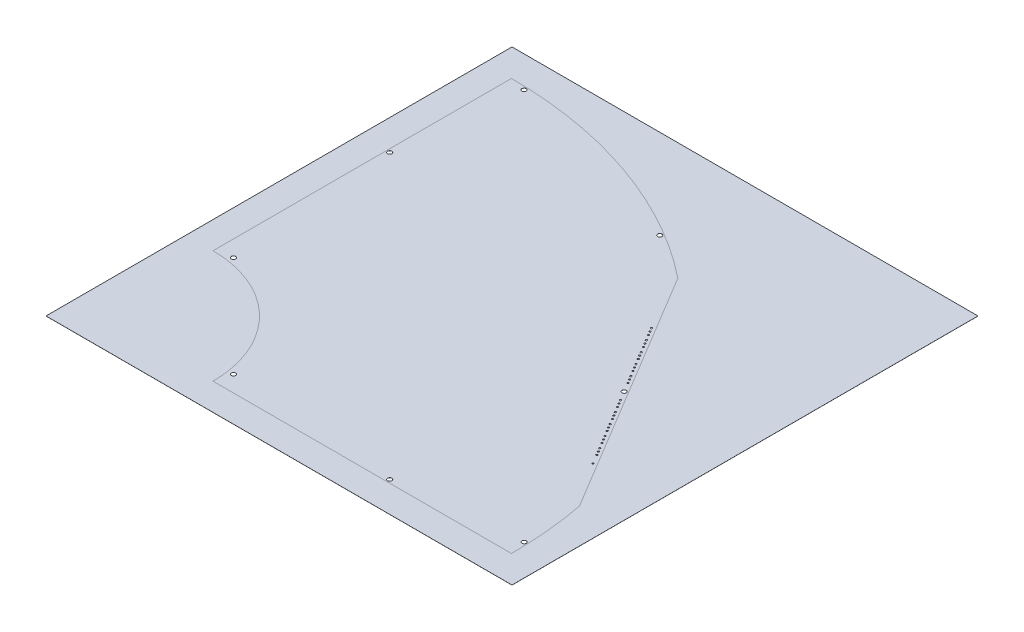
ISO-10303-21;
HEADER;
FILE_DESCRIPTION(('STEP AP214'),'2;1');
FILE_NAME('part.step','',(''),(''),'','','');
FILE_SCHEMA(('AUTOMOTIVE_DESIGN { 1 0 10303 214 1 1 1 1 }'));
ENDSEC;
DATA;
#1=APPLICATION_CONTEXT('core data for automotive mechanical design processes');
#2=APPLICATION_PROTOCOL_DEFINITION('international standard','automotive_design',2000,#1);
#3=PRODUCT_CONTEXT('',#1,'mechanical');
#4=PRODUCT('Part','Part','',(#3));
#5=PRODUCT_RELATED_PRODUCT_CATEGORY('part','',(#4));
#6=PRODUCT_DEFINITION_FORMATION('','',#4);
#7=PRODUCT_DEFINITION_CONTEXT('part definition',#1,'design');
#8=PRODUCT_DEFINITION('design','',#6,#7);
#9=PRODUCT_DEFINITION_SHAPE('','',#8);
#10=(LENGTH_UNIT() NAMED_UNIT(*) SI_UNIT(.MILLI.,.METRE.));
#11=(NAMED_UNIT(*) PLANE_ANGLE_UNIT() SI_UNIT($,.RADIAN.));
#12=(NAMED_UNIT(*) SI_UNIT($,.STERADIAN.) SOLID_ANGLE_UNIT());
#13=UNCERTAINTY_MEASURE_WITH_UNIT(LENGTH_MEASURE(1.E-05),#10,'distance_accuracy_value','');
#14=(GEOMETRIC_REPRESENTATION_CONTEXT(3) GLOBAL_UNCERTAINTY_ASSIGNED_CONTEXT((#13)) GLOBAL_UNIT_ASSIGNED_CONTEXT((#10,
#11,#12)) REPRESENTATION_CONTEXT('',''));
#15=CARTESIAN_POINT('',(0.,0.,0.));
#16=DIRECTION('',(0.,0.,1.));
#17=DIRECTION('',(1.,0.,0.));
#18=AXIS2_PLACEMENT_3D('',#15,#16,#17);
#19=CARTESIAN_POINT('',(-24.5,0.,-406.5));
#20=DIRECTION('',(0.,-1.,0.));
#21=DIRECTION('',(0.,0.,-1.));
#22=AXIS2_PLACEMENT_3D('',#19,#20,#21);
#23=PLANE('',#22);
#24=DIRECTION('',(0.,0.,1.));
#25=VECTOR('',#24,1.);
#26=CARTESIAN_POINT('',(-24.5,0.,24.5));
#27=LINE('',#26,#25);
#28=CARTESIAN_POINT('',(-24.5,0.,-406.5));
#29=VERTEX_POINT('',#28);
#30=CARTESIAN_POINT('',(-24.5,0.,24.5));
#31=VERTEX_POINT('',#30);
#32=EDGE_CURVE('E148',#29,#31,#27,.T.);
#33=ORIENTED_EDGE('',*,*,#32,.F.);
#34=DIRECTION('',(-1.,0.,0.));
#35=VECTOR('',#34,1.);
#36=CARTESIAN_POINT('',(-24.5,0.,-406.5));
#37=LINE('',#36,#35);
#38=CARTESIAN_POINT('',(406.5,0.,-406.5));
#39=VERTEX_POINT('',#38);
#40=EDGE_CURVE('E117',#39,#29,#37,.T.);
#41=ORIENTED_EDGE('',*,*,#40,.F.);
#42=DIRECTION('',(0.,0.,-1.));
#43=VECTOR('',#42,1.);
#44=CARTESIAN_POINT('',(406.5,0.,24.5));
#45=LINE('',#44,#43);
#46=CARTESIAN_POINT('',(406.5,0.,24.5));
#47=VERTEX_POINT('',#46);
#48=EDGE_CURVE('E142',#47,#39,#45,.T.);
#49=ORIENTED_EDGE('',*,*,#48,.F.);
#50=DIRECTION('',(1.,0.,0.));
#51=VECTOR('',#50,1.);
#52=CARTESIAN_POINT('',(-24.5,0.,24.5));
#53=LINE('',#52,#51);
#54=EDGE_CURVE('E138',#31,#47,#53,.T.);
#55=ORIENTED_EDGE('',*,*,#54,.F.);
#56=EDGE_LOOP('',(#33,#41,#49,#55));
#57=FACE_BOUND('',#56,.T.);
#58=DIRECTION('',(0.,0.,1.));
#59=VECTOR('',#58,1.);
#60=CARTESIAN_POINT('',(0.499999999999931,0.,-380.999671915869));
#61=LINE('',#60,#59);
#62=CARTESIAN_POINT('',(0.499999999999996,0.,-380.999671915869));
#63=VERTEX_POINT('',#62);
#64=CARTESIAN_POINT('',(0.499999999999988,0.,-104.998809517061));
#65=VERTEX_POINT('',#64);
#66=EDGE_CURVE('E128',#63,#65,#61,.T.);
#67=ORIENTED_EDGE('',*,*,#66,.T.);
#68=CARTESIAN_POINT('',(0.,0.,0.));
#69=DIRECTION('',(0.,-1.,0.));
#70=DIRECTION('',(0.,0.,1.));
#71=AXIS2_PLACEMENT_3D('',#68,#69,#70);
#72=CIRCLE('',#71,105.);
#73=CARTESIAN_POINT('',(104.998809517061,0.,-0.499999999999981));
#74=VERTEX_POINT('',#73);
#75=EDGE_CURVE('E113',#65,#74,#72,.T.);
#76=ORIENTED_EDGE('',*,*,#75,.T.);
#77=DIRECTION('',(1.,0.,0.));
#78=VECTOR('',#77,1.);
#79=CARTESIAN_POINT('',(104.998809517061,0.,-0.499999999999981));
#80=LINE('',#79,#78);
#81=CARTESIAN_POINT('',(380.999671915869,0.,-0.499999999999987));
#82=VERTEX_POINT('',#81);
#83=EDGE_CURVE('E120',#74,#82,#80,.T.);
#84=ORIENTED_EDGE('',*,*,#83,.T.);
#85=CARTESIAN_POINT('',(0.,0.,0.));
#86=DIRECTION('',(0.,1.,0.));
#87=DIRECTION('',(0.,0.,1.));
#88=AXIS2_PLACEMENT_3D('',#85,#86,#87);
#89=CIRCLE('',#88,381.);
#90=CARTESIAN_POINT('',(374.553309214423,0.,-69.7912498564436));
#91=VERTEX_POINT('',#90);
#92=EDGE_CURVE('E124',#82,#91,#89,.T.);
#93=ORIENTED_EDGE('',*,*,#92,.T.);
#94=DIRECTION('',(-0.515038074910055,0.,-0.857167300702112));
#95=VECTOR('',#94,1.);
#96=CARTESIAN_POINT('',(374.553309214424,0.,-69.7912498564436));
#97=LINE('',#96,#95);
#98=CARTESIAN_POINT('',(237.464143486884,0.,-297.945935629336));
#99=VERTEX_POINT('',#98);
#100=EDGE_CURVE('E189',#91,#99,#97,.T.);
#101=ORIENTED_EDGE('',*,*,#100,.T.);
#102=CARTESIAN_POINT('',(0.,0.,0.));
#103=DIRECTION('',(0.,1.,0.));
#104=DIRECTION('',(0.,0.,1.));
#105=AXIS2_PLACEMENT_3D('',#102,#103,#104);
#106=CIRCLE('',#105,381.);
#107=EDGE_CURVE('E160',#99,#63,#106,.T.);
#108=ORIENTED_EDGE('',*,*,#107,.T.);
#109=EDGE_LOOP('',(#67,#76,#84,#93,#101,#108));
#110=FACE_BOUND('',#109,.T.);
#111=ADVANCED_FACE('F40',(#57,#110),#23,.T.);
#112=CARTESIAN_POINT('',(-24.5,609.586045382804,24.5));
#113=DIRECTION('',(1.,0.,0.));
#114=DIRECTION('',(0.,0.,-1.));
#115=AXIS2_PLACEMENT_3D('',#112,#113,#114);
#116=PLANE('',#115);
#117=DIRECTION('',(0.,-1.,0.));
#118=VECTOR('',#117,1.);
#119=CARTESIAN_POINT('',(-24.5,609.586045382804,24.5));
#120=LINE('',#119,#118);
#121=CARTESIAN_POINT('',(-24.5,0.059999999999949,24.5));
#122=VERTEX_POINT('',#121);
#123=EDGE_CURVE('E136',#122,#31,#120,.T.);
#124=ORIENTED_EDGE('',*,*,#123,.F.);
#125=DIRECTION('',(0.,0.,-1.));
#126=VECTOR('',#125,1.);
#127=CARTESIAN_POINT('',(-24.5,0.059999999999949,24.5));
#128=LINE('',#127,#126);
#129=CARTESIAN_POINT('',(-24.5,0.059999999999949,-406.5));
#130=VERTEX_POINT('',#129);
#131=EDGE_CURVE('E59',#122,#130,#128,.T.);
#132=ORIENTED_EDGE('',*,*,#131,.T.);
#133=DIRECTION('',(0.,-1.,0.));
#134=VECTOR('',#133,1.);
#135=CARTESIAN_POINT('',(-24.5,609.586045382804,-406.5));
#136=LINE('',#135,#134);
#137=EDGE_CURVE('E147',#130,#29,#136,.T.);
#138=ORIENTED_EDGE('',*,*,#137,.T.);
#139=ORIENTED_EDGE('',*,*,#32,.T.);
#140=EDGE_LOOP('',(#124,#132,#138,#139));
#141=FACE_BOUND('',#140,.T.);
#142=ADVANCED_FACE('F210',(#141),#116,.F.);
#143=CARTESIAN_POINT('',(-24.5,609.586045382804,24.5));
#144=DIRECTION('',(0.,0.,-1.));
#145=DIRECTION('',(-1.,0.,0.));
#146=AXIS2_PLACEMENT_3D('',#143,#144,#145);
#147=PLANE('',#146);
#148=DIRECTION('',(0.,-1.,0.));
#149=VECTOR('',#148,1.);
#150=CARTESIAN_POINT('',(406.5,609.586045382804,24.5));
#151=LINE('',#150,#149);
#152=CARTESIAN_POINT('',(406.5,0.059999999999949,24.5));
#153=VERTEX_POINT('',#152);
#154=EDGE_CURVE('E140',#153,#47,#151,.T.);
#155=ORIENTED_EDGE('',*,*,#154,.F.);
#156=DIRECTION('',(-1.,0.,0.));
#157=VECTOR('',#156,1.);
#158=CARTESIAN_POINT('',(-24.5,0.059999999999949,24.5));
#159=LINE('',#158,#157);
#160=EDGE_CURVE('E139',#153,#122,#159,.T.);
#161=ORIENTED_EDGE('',*,*,#160,.T.);
#162=ORIENTED_EDGE('',*,*,#123,.T.);
#163=ORIENTED_EDGE('',*,*,#54,.T.);
#164=EDGE_LOOP('',(#155,#161,#162,#163));
#165=FACE_BOUND('',#164,.T.);
#166=ADVANCED_FACE('F213',(#165),#147,.F.);
#167=CARTESIAN_POINT('',(406.5,609.586045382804,24.5));
#168=DIRECTION('',(-1.,0.,0.));
#169=DIRECTION('',(0.,0.,1.));
#170=AXIS2_PLACEMENT_3D('',#167,#168,#169);
#171=PLANE('',#170);
#172=DIRECTION('',(0.,-1.,0.));
#173=VECTOR('',#172,1.);
#174=CARTESIAN_POINT('',(406.5,609.586045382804,-406.5));
#175=LINE('',#174,#173);
#176=CARTESIAN_POINT('',(406.5,0.059999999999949,-406.5));
#177=VERTEX_POINT('',#176);
#178=EDGE_CURVE('E144',#177,#39,#175,.T.);
#179=ORIENTED_EDGE('',*,*,#178,.F.);
#180=DIRECTION('',(0.,0.,1.));
#181=VECTOR('',#180,1.);
#182=CARTESIAN_POINT('',(406.5,0.059999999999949,24.5));
#183=LINE('',#182,#181);
#184=EDGE_CURVE('E143',#177,#153,#183,.T.);
#185=ORIENTED_EDGE('',*,*,#184,.T.);
#186=ORIENTED_EDGE('',*,*,#154,.T.);
#187=ORIENTED_EDGE('',*,*,#48,.T.);
#188=EDGE_LOOP('',(#179,#185,#186,#187));
#189=FACE_BOUND('',#188,.T.);
#190=ADVANCED_FACE('F238',(#189),#171,.F.);
#191=CARTESIAN_POINT('',(-24.5,609.586045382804,-406.5));
#192=DIRECTION('',(0.,0.,1.));
#193=DIRECTION('',(1.,0.,0.));
#194=AXIS2_PLACEMENT_3D('',#191,#192,#193);
#195=PLANE('',#194);
#196=ORIENTED_EDGE('',*,*,#137,.F.);
#197=DIRECTION('',(1.,0.,0.));
#198=VECTOR('',#197,1.);
#199=CARTESIAN_POINT('',(-24.5,0.059999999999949,-406.5));
#200=LINE('',#199,#198);
#201=EDGE_CURVE('E146',#130,#177,#200,.T.);
#202=ORIENTED_EDGE('',*,*,#201,.T.);
#203=ORIENTED_EDGE('',*,*,#178,.T.);
#204=ORIENTED_EDGE('',*,*,#40,.T.);
#205=EDGE_LOOP('',(#196,#202,#203,#204));
#206=FACE_BOUND('',#205,.T.);
#207=ADVANCED_FACE('F204',(#206),#195,.F.);
#208=CARTESIAN_POINT('',(0.,609.586045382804,0.));
#209=DIRECTION('',(0.,-1.,0.));
#210=DIRECTION('',(0.,0.,-1.));
#211=AXIS2_PLACEMENT_3D('',#208,#209,#210);
#212=CYLINDRICAL_SURFACE('',#211,105.);
#213=CARTESIAN_POINT('',(0.,0.059999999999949,0.));
#214=DIRECTION('',(0.,-1.,0.));
#215=DIRECTION('',(0.,0.,-1.));
#216=AXIS2_PLACEMENT_3D('',#213,#214,#215);
#217=CIRCLE('',#216,105.);
#218=CARTESIAN_POINT('',(104.998809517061,0.059999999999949,-0.499999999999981));
#219=VERTEX_POINT('',#218);
#220=CARTESIAN_POINT('',(0.499999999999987,0.059999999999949,-104.998809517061));
#221=VERTEX_POINT('',#220);
#222=EDGE_CURVE('E116',#219,#221,#217,.F.);
#223=ORIENTED_EDGE('',*,*,#222,.F.);
#224=DIRECTION('',(0.,-1.,0.));
#225=VECTOR('',#224,1.);
#226=CARTESIAN_POINT('',(104.998809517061,609.586045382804,-0.499999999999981));
#227=LINE('',#226,#225);
#228=EDGE_CURVE('E109',#219,#74,#227,.T.);
#229=ORIENTED_EDGE('',*,*,#228,.T.);
#230=ORIENTED_EDGE('',*,*,#75,.F.);
#231=DIRECTION('',(0.,-1.,0.));
#232=VECTOR('',#231,1.);
#233=CARTESIAN_POINT('',(0.499999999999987,609.586045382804,-104.998809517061));
#234=LINE('',#233,#232);
#235=EDGE_CURVE('E157',#221,#65,#234,.T.);
#236=ORIENTED_EDGE('',*,*,#235,.F.);
#237=EDGE_LOOP('',(#223,#229,#230,#236));
#238=FACE_BOUND('',#237,.T.);
#239=ADVANCED_FACE('F110',(#238),#212,.T.);
#240=CARTESIAN_POINT('',(104.998809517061,609.586045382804,-0.499999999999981));
#241=DIRECTION('',(0.,0.,-1.));
#242=DIRECTION('',(-1.,0.,0.));
#243=AXIS2_PLACEMENT_3D('',#240,#241,#242);
#244=PLANE('',#243);
#245=DIRECTION('',(-1.,0.,0.));
#246=VECTOR('',#245,1.);
#247=CARTESIAN_POINT('',(104.998809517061,0.059999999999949,-0.499999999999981));
#248=LINE('',#247,#246);
#249=CARTESIAN_POINT('',(380.999671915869,0.059999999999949,-0.499999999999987));
#250=VERTEX_POINT('',#249);
#251=EDGE_CURVE('E12',#250,#219,#248,.T.);
#252=ORIENTED_EDGE('',*,*,#251,.F.);
#253=DIRECTION('',(0.,-1.,0.));
#254=VECTOR('',#253,1.);
#255=CARTESIAN_POINT('',(380.999671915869,609.586045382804,-0.499999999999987));
#256=LINE('',#255,#254);
#257=EDGE_CURVE('E102',#250,#82,#256,.T.);
#258=ORIENTED_EDGE('',*,*,#257,.T.);
#259=ORIENTED_EDGE('',*,*,#83,.F.);
#260=ORIENTED_EDGE('',*,*,#228,.F.);
#261=EDGE_LOOP('',(#252,#258,#259,#260));
#262=FACE_BOUND('',#261,.T.);
#263=ADVANCED_FACE('F121',(#262),#244,.T.);
#264=CARTESIAN_POINT('',(0.,609.586045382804,0.));
#265=DIRECTION('',(0.,-1.,0.));
#266=DIRECTION('',(0.,0.,-1.));
#267=AXIS2_PLACEMENT_3D('',#264,#265,#266);
#268=CYLINDRICAL_SURFACE('',#267,381.);
#269=CARTESIAN_POINT('',(0.,0.059999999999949,0.));
#270=DIRECTION('',(0.,-1.,0.));
#271=DIRECTION('',(0.,0.,-1.));
#272=AXIS2_PLACEMENT_3D('',#269,#270,#271);
#273=CIRCLE('',#272,381.);
#274=CARTESIAN_POINT('',(374.553309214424,0.059999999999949,-69.7912498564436));
#275=VERTEX_POINT('',#274);
#276=EDGE_CURVE('E50',#275,#250,#273,.T.);
#277=ORIENTED_EDGE('',*,*,#276,.F.);
#278=DIRECTION('',(0.,-1.,0.));
#279=VECTOR('',#278,1.);
#280=CARTESIAN_POINT('',(374.553309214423,609.586045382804,-69.7912498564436));
#281=LINE('',#280,#279);
#282=EDGE_CURVE('E151',#275,#91,#281,.T.);
#283=ORIENTED_EDGE('',*,*,#282,.T.);
#284=ORIENTED_EDGE('',*,*,#92,.F.);
#285=ORIENTED_EDGE('',*,*,#257,.F.);
#286=EDGE_LOOP('',(#277,#283,#284,#285));
#287=FACE_BOUND('',#286,.T.);
#288=ADVANCED_FACE('F220',(#287),#268,.F.);
#289=CARTESIAN_POINT('',(374.553309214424,609.586045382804,-69.7912498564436));
#290=DIRECTION('',(-0.857167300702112,0.,0.515038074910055));
#291=DIRECTION('',(0.515038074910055,0.,0.857167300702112));
#292=AXIS2_PLACEMENT_3D('',#289,#290,#291);
#293=PLANE('',#292);
#294=DIRECTION('',(0.515038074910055,0.,0.857167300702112));
#295=VECTOR('',#294,1.);
#296=CARTESIAN_POINT('',(374.553309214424,0.059999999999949,-69.7912498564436));
#297=LINE('',#296,#295);
#298=CARTESIAN_POINT('',(237.464143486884,0.059999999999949,-297.945935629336));
#299=VERTEX_POINT('',#298);
#300=EDGE_CURVE('E169',#299,#275,#297,.T.);
#301=ORIENTED_EDGE('',*,*,#300,.F.);
#302=DIRECTION('',(0.,-1.,0.));
#303=VECTOR('',#302,1.);
#304=CARTESIAN_POINT('',(237.464143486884,609.586045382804,-297.945935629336));
#305=LINE('',#304,#303);
#306=EDGE_CURVE('E153',#299,#99,#305,.T.);
#307=ORIENTED_EDGE('',*,*,#306,.T.);
#308=ORIENTED_EDGE('',*,*,#100,.F.);
#309=ORIENTED_EDGE('',*,*,#282,.F.);
#310=EDGE_LOOP('',(#301,#307,#308,#309));
#311=FACE_BOUND('',#310,.T.);
#312=ADVANCED_FACE('F184',(#311),#293,.T.);
#313=CARTESIAN_POINT('',(0.,609.586045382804,0.));
#314=DIRECTION('',(0.,-1.,0.));
#315=DIRECTION('',(0.,0.,-1.));
#316=AXIS2_PLACEMENT_3D('',#313,#314,#315);
#317=CYLINDRICAL_SURFACE('',#316,381.);
#318=CARTESIAN_POINT('',(0.,0.059999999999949,0.));
#319=DIRECTION('',(0.,-1.,0.));
#320=DIRECTION('',(0.,0.,-1.));
#321=AXIS2_PLACEMENT_3D('',#318,#319,#320);
#322=CIRCLE('',#321,381.);
#323=CARTESIAN_POINT('',(0.499999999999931,0.059999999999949,-380.999671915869));
#324=VERTEX_POINT('',#323);
#325=EDGE_CURVE('E44',#324,#299,#322,.T.);
#326=ORIENTED_EDGE('',*,*,#325,.F.);
#327=DIRECTION('',(0.,-1.,0.));
#328=VECTOR('',#327,1.);
#329=CARTESIAN_POINT('',(0.499999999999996,609.586045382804,-380.999671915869));
#330=LINE('',#329,#328);
#331=EDGE_CURVE('E155',#324,#63,#330,.T.);
#332=ORIENTED_EDGE('',*,*,#331,.T.);
#333=ORIENTED_EDGE('',*,*,#107,.F.);
#334=ORIENTED_EDGE('',*,*,#306,.F.);
#335=EDGE_LOOP('',(#326,#332,#333,#334));
#336=FACE_BOUND('',#335,.T.);
#337=ADVANCED_FACE('F187',(#336),#317,.F.);
#338=CARTESIAN_POINT('',(0.499999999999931,609.586045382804,-380.999671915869));
#339=DIRECTION('',(1.,0.,0.));
#340=DIRECTION('',(0.,0.,-1.));
#341=AXIS2_PLACEMENT_3D('',#338,#339,#340);
#342=PLANE('',#341);
#343=DIRECTION('',(0.,0.,-1.));
#344=VECTOR('',#343,1.);
#345=CARTESIAN_POINT('',(0.499999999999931,0.059999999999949,-380.999671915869));
#346=LINE('',#345,#344);
#347=EDGE_CURVE('E133',#221,#324,#346,.T.);
#348=ORIENTED_EDGE('',*,*,#347,.F.);
#349=ORIENTED_EDGE('',*,*,#235,.T.);
#350=ORIENTED_EDGE('',*,*,#66,.F.);
#351=ORIENTED_EDGE('',*,*,#331,.F.);
#352=EDGE_LOOP('',(#348,#349,#350,#351));
#353=FACE_BOUND('',#352,.T.);
#354=ADVANCED_FACE('F244',(#353),#342,.T.);
#355=CARTESIAN_POINT('',(0.,0.06,0.));
#356=DIRECTION('',(0.,-1.,0.));
#357=DIRECTION('',(0.,0.,-1.));
#358=AXIS2_PLACEMENT_3D('',#355,#356,#357);
#359=PLANE('',#358);
#360=ORIENTED_EDGE('',*,*,#222,.T.);
#361=ORIENTED_EDGE('',*,*,#347,.T.);
#362=ORIENTED_EDGE('',*,*,#325,.T.);
#363=ORIENTED_EDGE('',*,*,#300,.T.);
#364=ORIENTED_EDGE('',*,*,#276,.T.);
#365=ORIENTED_EDGE('',*,*,#251,.T.);
#366=EDGE_LOOP('',(#360,#361,#362,#363,#364,#365));
#367=FACE_BOUND('',#366,.T.);
#368=ORIENTED_EDGE('',*,*,#160,.F.);
#369=ORIENTED_EDGE('',*,*,#184,.F.);
#370=ORIENTED_EDGE('',*,*,#201,.F.);
#371=ORIENTED_EDGE('',*,*,#131,.F.);
#372=EDGE_LOOP('',(#368,#369,#370,#371));
#373=FACE_BOUND('',#372,.T.);
#374=ADVANCED_FACE('F42',(#367,#373),#359,.F.);
#375=CLOSED_SHELL('',(#111,#142,#166,#190,#207,#239,#263,#288,#312,#337,#354,#374));
#376=MANIFOLD_SOLID_BREP('B2',#375);
#377=CARTESIAN_POINT('',(0.,0.06,0.));
#378=DIRECTION('',(0.,-1.,0.));
#379=DIRECTION('',(0.,0.,-1.));
#380=AXIS2_PLACEMENT_3D('',#377,#378,#379);
#381=PLANE('',#380);
#382=CARTESIAN_POINT('',(346.700422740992,0.06,-110.321425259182));
#383=DIRECTION('',(0.,-1.,0.));
#384=DIRECTION('',(0.,0.,-1.));
#385=AXIS2_PLACEMENT_3D('',#382,#383,#384);
#386=CIRCLE('',#385,0.749999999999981);
#387=CARTESIAN_POINT('',(346.700422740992,0.06,-111.071425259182));
#388=VERTEX_POINT('',#387);
#389=EDGE_CURVE('E608',#388,#388,#386,.T.);
#390=ORIENTED_EDGE('',*,*,#389,.T.);
#391=EDGE_LOOP('',(#390));
#392=FACE_BOUND('',#391,.T.);
#393=CARTESIAN_POINT('',(308.587605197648,0.06,-173.751805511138));
#394=DIRECTION('',(0.,-1.,0.));
#395=DIRECTION('',(0.,0.,1.));
#396=AXIS2_PLACEMENT_3D('',#393,#394,#395);
#397=CIRCLE('',#396,0.74999999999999);
#398=CARTESIAN_POINT('',(308.587605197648,0.06,-173.001805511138));
#399=VERTEX_POINT('',#398);
#400=EDGE_CURVE('E616',#399,#399,#397,.T.);
#401=ORIENTED_EDGE('',*,*,#400,.T.);
#402=EDGE_LOOP('',(#401));
#403=FACE_BOUND('',#402,.T.);
#404=CARTESIAN_POINT('',(315.798138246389,0.06,-161.751463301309));
#405=DIRECTION('',(0.,-1.,0.));
#406=DIRECTION('',(0.,0.,1.));
#407=AXIS2_PLACEMENT_3D('',#404,#405,#406);
#408=CIRCLE('',#407,0.750000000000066);
#409=CARTESIAN_POINT('',(315.798138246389,0.06,-161.001463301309));
#410=VERTEX_POINT('',#409);
#411=EDGE_CURVE('E622',#410,#410,#408,.T.);
#412=ORIENTED_EDGE('',*,*,#411,.T.);
#413=EDGE_LOOP('',(#412));
#414=FACE_BOUND('',#413,.T.);
#415=CARTESIAN_POINT('',(317.858290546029,0.06,-158.3227940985));
#416=DIRECTION('',(0.,-1.,0.));
#417=DIRECTION('',(0.,0.,1.));
#418=AXIS2_PLACEMENT_3D('',#415,#416,#417);
#419=CIRCLE('',#418,0.750000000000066);
#420=CARTESIAN_POINT('',(317.858290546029,0.06,-157.5727940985));
#421=VERTEX_POINT('',#420);
#422=EDGE_CURVE('E628',#421,#421,#419,.T.);
#423=ORIENTED_EDGE('',*,*,#422,.T.);
#424=EDGE_LOOP('',(#423));
#425=FACE_BOUND('',#424,.T.);
#426=CARTESIAN_POINT('',(310.647757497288,0.06,-170.32313630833));
#427=DIRECTION('',(0.,-1.,0.));
#428=DIRECTION('',(0.,0.,1.));
#429=AXIS2_PLACEMENT_3D('',#426,#427,#428);
#430=CIRCLE('',#429,0.750000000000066);
#431=CARTESIAN_POINT('',(310.647757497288,0.06,-169.57313630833));
#432=VERTEX_POINT('',#431);
#433=EDGE_CURVE('E634',#432,#432,#430,.T.);
#434=ORIENTED_EDGE('',*,*,#433,.T.);
#435=EDGE_LOOP('',(#434));
#436=FACE_BOUND('',#435,.T.);
#437=CARTESIAN_POINT('',(312.707909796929,0.06,-166.894467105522));
#438=DIRECTION('',(0.,-1.,0.));
#439=DIRECTION('',(0.,0.,1.));
#440=AXIS2_PLACEMENT_3D('',#437,#438,#439);
#441=CIRCLE('',#440,0.74999999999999);
#442=CARTESIAN_POINT('',(312.707909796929,0.06,-166.144467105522));
#443=VERTEX_POINT('',#442);
#444=EDGE_CURVE('E640',#443,#443,#441,.T.);
#445=ORIENTED_EDGE('',*,*,#444,.T.);
#446=EDGE_LOOP('',(#445));
#447=FACE_BOUND('',#446,.T.);
#448=CARTESIAN_POINT('',(319.91844284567,0.06,-154.894124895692));
#449=DIRECTION('',(0.,-1.,0.));
#450=DIRECTION('',(0.,0.,1.));
#451=AXIS2_PLACEMENT_3D('',#448,#449,#450);
#452=CIRCLE('',#451,0.750000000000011);
#453=CARTESIAN_POINT('',(319.91844284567,0.06,-154.144124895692));
#454=VERTEX_POINT('',#453);
#455=EDGE_CURVE('E646',#454,#454,#452,.T.);
#456=ORIENTED_EDGE('',*,*,#455,.T.);
#457=EDGE_LOOP('',(#456));
#458=FACE_BOUND('',#457,.T.);
#459=CARTESIAN_POINT('',(323.00867129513,0.06,-149.751121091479));
#460=DIRECTION('',(0.,-1.,0.));
#461=DIRECTION('',(0.,0.,1.));
#462=AXIS2_PLACEMENT_3D('',#459,#460,#461);
#463=CIRCLE('',#462,0.750000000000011);
#464=CARTESIAN_POINT('',(323.00867129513,0.06,-149.001121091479));
#465=VERTEX_POINT('',#464);
#466=EDGE_CURVE('E652',#465,#465,#463,.T.);
#467=ORIENTED_EDGE('',*,*,#466,.T.);
#468=EDGE_LOOP('',(#467));
#469=FACE_BOUND('',#468,.T.);
#470=CARTESIAN_POINT('',(325.06882359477,0.06,-146.322451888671));
#471=DIRECTION('',(0.,-1.,0.));
#472=DIRECTION('',(0.,0.,1.));
#473=AXIS2_PLACEMENT_3D('',#470,#471,#472);
#474=CIRCLE('',#473,0.750000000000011);
#475=CARTESIAN_POINT('',(325.06882359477,0.06,-145.572451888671));
#476=VERTEX_POINT('',#475);
#477=EDGE_CURVE('E658',#476,#476,#474,.T.);
#478=ORIENTED_EDGE('',*,*,#477,.T.);
#479=EDGE_LOOP('',(#478));
#480=FACE_BOUND('',#479,.T.);
#481=CARTESIAN_POINT('',(327.12897589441,0.06,-142.893782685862));
#482=DIRECTION('',(0.,-1.,0.));
#483=DIRECTION('',(0.,0.,1.));
#484=AXIS2_PLACEMENT_3D('',#481,#482,#483);
#485=CIRCLE('',#484,0.749999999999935);
#486=CARTESIAN_POINT('',(327.12897589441,0.06,-142.143782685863));
#487=VERTEX_POINT('',#486);
#488=EDGE_CURVE('E664',#487,#487,#485,.T.);
#489=ORIENTED_EDGE('',*,*,#488,.T.);
#490=EDGE_LOOP('',(#489));
#491=FACE_BOUND('',#490,.T.);
#492=CARTESIAN_POINT('',(330.219204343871,0.06,-137.75077888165));
#493=DIRECTION('',(0.,-1.,0.));
#494=DIRECTION('',(0.,0.,1.));
#495=AXIS2_PLACEMENT_3D('',#492,#493,#494);
#496=CIRCLE('',#495,0.749999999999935);
#497=CARTESIAN_POINT('',(330.219204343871,0.06,-137.00077888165));
#498=VERTEX_POINT('',#497);
#499=EDGE_CURVE('E670',#498,#498,#496,.T.);
#500=ORIENTED_EDGE('',*,*,#499,.T.);
#501=EDGE_LOOP('',(#500));
#502=FACE_BOUND('',#501,.T.);
#503=CARTESIAN_POINT('',(332.279356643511,0.06,-134.322109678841));
#504=DIRECTION('',(0.,-1.,0.));
#505=DIRECTION('',(0.,0.,1.));
#506=AXIS2_PLACEMENT_3D('',#503,#504,#505);
#507=CIRCLE('',#506,0.749999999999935);
#508=CARTESIAN_POINT('',(332.279356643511,0.06,-133.572109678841));
#509=VERTEX_POINT('',#508);
#510=EDGE_CURVE('E676',#509,#509,#507,.T.);
#511=ORIENTED_EDGE('',*,*,#510,.T.);
#512=EDGE_LOOP('',(#511));
#513=FACE_BOUND('',#512,.T.);
#514=CARTESIAN_POINT('',(334.339508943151,0.06,-130.893440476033));
#515=DIRECTION('',(0.,-1.,0.));
#516=DIRECTION('',(0.,0.,1.));
#517=AXIS2_PLACEMENT_3D('',#514,#515,#516);
#518=CIRCLE('',#517,0.749999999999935);
#519=CARTESIAN_POINT('',(334.339508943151,0.06,-130.143440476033));
#520=VERTEX_POINT('',#519);
#521=EDGE_CURVE('E682',#520,#520,#518,.T.);
#522=ORIENTED_EDGE('',*,*,#521,.T.);
#523=EDGE_LOOP('',(#522));
#524=FACE_BOUND('',#523,.T.);
#525=CARTESIAN_POINT('',(337.429737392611,0.06,-125.75043667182));
#526=DIRECTION('',(0.,-1.,0.));
#527=DIRECTION('',(0.,0.,1.));
#528=AXIS2_PLACEMENT_3D('',#525,#526,#527);
#529=CIRCLE('',#528,0.749999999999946);
#530=CARTESIAN_POINT('',(337.429737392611,0.06,-125.00043667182));
#531=VERTEX_POINT('',#530);
#532=EDGE_CURVE('E688',#531,#531,#529,.T.);
#533=ORIENTED_EDGE('',*,*,#532,.T.);
#534=EDGE_LOOP('',(#533));
#535=FACE_BOUND('',#534,.T.);
#536=CARTESIAN_POINT('',(339.489889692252,0.06,-122.321767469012));
#537=DIRECTION('',(0.,-1.,0.));
#538=DIRECTION('',(0.,0.,1.));
#539=AXIS2_PLACEMENT_3D('',#536,#537,#538);
#540=CIRCLE('',#539,0.750000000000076);
#541=CARTESIAN_POINT('',(339.489889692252,0.06,-121.571767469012));
#542=VERTEX_POINT('',#541);
#543=EDGE_CURVE('E694',#542,#542,#540,.T.);
#544=ORIENTED_EDGE('',*,*,#543,.T.);
#545=EDGE_LOOP('',(#544));
#546=FACE_BOUND('',#545,.T.);
#547=CARTESIAN_POINT('',(265.324406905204,0.06,-245.753858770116));
#548=DIRECTION('',(0.,-1.,0.));
#549=DIRECTION('',(0.,0.,-1.));
#550=AXIS2_PLACEMENT_3D('',#547,#548,#549);
#551=CIRCLE('',#550,0.750000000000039);
#552=CARTESIAN_POINT('',(265.324406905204,0.06,-246.503858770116));
#553=VERTEX_POINT('',#552);
#554=EDGE_CURVE('E700',#553,#553,#551,.T.);
#555=ORIENTED_EDGE('',*,*,#554,.T.);
#556=EDGE_LOOP('',(#555));
#557=FACE_BOUND('',#556,.T.);
#558=CARTESIAN_POINT('',(267.384559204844,0.06,-242.325189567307));
#559=DIRECTION('',(0.,-1.,0.));
#560=DIRECTION('',(0.,0.,-1.));
#561=AXIS2_PLACEMENT_3D('',#558,#559,#560);
#562=CIRCLE('',#561,0.750000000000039);
#563=CARTESIAN_POINT('',(267.384559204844,0.06,-243.075189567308));
#564=VERTEX_POINT('',#563);
#565=EDGE_CURVE('E706',#564,#564,#562,.T.);
#566=ORIENTED_EDGE('',*,*,#565,.T.);
#567=EDGE_LOOP('',(#566));
#568=FACE_BOUND('',#567,.T.);
#569=CARTESIAN_POINT('',(269.444711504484,0.06,-238.896520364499));
#570=DIRECTION('',(0.,-1.,0.));
#571=DIRECTION('',(0.,0.,-1.));
#572=AXIS2_PLACEMENT_3D('',#569,#570,#571);
#573=CIRCLE('',#572,0.749999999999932);
#574=CARTESIAN_POINT('',(269.444711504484,0.06,-239.646520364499));
#575=VERTEX_POINT('',#574);
#576=EDGE_CURVE('E712',#575,#575,#573,.T.);
#577=ORIENTED_EDGE('',*,*,#576,.T.);
#578=EDGE_LOOP('',(#577));
#579=FACE_BOUND('',#578,.T.);
#580=CARTESIAN_POINT('',(272.534939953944,0.06,-233.753516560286));
#581=DIRECTION('',(0.,-1.,0.));
#582=DIRECTION('',(0.,0.,-1.));
#583=AXIS2_PLACEMENT_3D('',#580,#581,#582);
#584=CIRCLE('',#583,0.749999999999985);
#585=CARTESIAN_POINT('',(272.534939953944,0.06,-234.503516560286));
#586=VERTEX_POINT('',#585);
#587=EDGE_CURVE('E718',#586,#586,#584,.T.);
#588=ORIENTED_EDGE('',*,*,#587,.T.);
#589=EDGE_LOOP('',(#588));
#590=FACE_BOUND('',#589,.T.);
#591=CARTESIAN_POINT('',(274.595092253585,0.06,-230.324847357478));
#592=DIRECTION('',(0.,-1.,0.));
#593=DIRECTION('',(0.,0.,-1.));
#594=AXIS2_PLACEMENT_3D('',#591,#592,#593);
#595=CIRCLE('',#594,0.749999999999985);
#596=CARTESIAN_POINT('',(274.595092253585,0.06,-231.074847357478));
#597=VERTEX_POINT('',#596);
#598=EDGE_CURVE('E724',#597,#597,#595,.T.);
#599=ORIENTED_EDGE('',*,*,#598,.T.);
#600=EDGE_LOOP('',(#599));
#601=FACE_BOUND('',#600,.T.);
#602=CARTESIAN_POINT('',(276.655244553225,0.06,-226.896178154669));
#603=DIRECTION('',(0.,-1.,0.));
#604=DIRECTION('',(0.,0.,-1.));
#605=AXIS2_PLACEMENT_3D('',#602,#603,#604);
#606=CIRCLE('',#605,0.749999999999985);
#607=CARTESIAN_POINT('',(276.655244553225,0.06,-227.646178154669));
#608=VERTEX_POINT('',#607);
#609=EDGE_CURVE('E730',#608,#608,#606,.T.);
#610=ORIENTED_EDGE('',*,*,#609,.T.);
#611=EDGE_LOOP('',(#610));
#612=FACE_BOUND('',#611,.T.);
#613=CARTESIAN_POINT('',(279.745473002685,0.06,-221.753174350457));
#614=DIRECTION('',(0.,-1.,0.));
#615=DIRECTION('',(0.,0.,-1.));
#616=AXIS2_PLACEMENT_3D('',#613,#614,#615);
#617=CIRCLE('',#616,0.749999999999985);
#618=CARTESIAN_POINT('',(279.745473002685,0.06,-222.503174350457));
#619=VERTEX_POINT('',#618);
#620=EDGE_CURVE('E736',#619,#619,#617,.T.);
#621=ORIENTED_EDGE('',*,*,#620,.T.);
#622=EDGE_LOOP('',(#621));
#623=FACE_BOUND('',#622,.T.);
#624=CARTESIAN_POINT('',(281.805625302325,0.06,-218.324505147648));
#625=DIRECTION('',(0.,-1.,0.));
#626=DIRECTION('',(0.,0.,-1.));
#627=AXIS2_PLACEMENT_3D('',#624,#625,#626);
#628=CIRCLE('',#627,0.749999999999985);
#629=CARTESIAN_POINT('',(281.805625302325,0.06,-219.074505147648));
#630=VERTEX_POINT('',#629);
#631=EDGE_CURVE('E742',#630,#630,#628,.T.);
#632=ORIENTED_EDGE('',*,*,#631,.T.);
#633=EDGE_LOOP('',(#632));
#634=FACE_BOUND('',#633,.T.);
#635=CARTESIAN_POINT('',(283.865777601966,0.06,-214.89583594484));
#636=DIRECTION('',(0.,-1.,0.));
#637=DIRECTION('',(0.,0.,-1.));
#638=AXIS2_PLACEMENT_3D('',#635,#636,#637);
#639=CIRCLE('',#638,0.749999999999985);
#640=CARTESIAN_POINT('',(283.865777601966,0.06,-215.64583594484));
#641=VERTEX_POINT('',#640);
#642=EDGE_CURVE('E748',#641,#641,#639,.T.);
#643=ORIENTED_EDGE('',*,*,#642,.T.);
#644=EDGE_LOOP('',(#643));
#645=FACE_BOUND('',#644,.T.);
#646=CARTESIAN_POINT('',(286.956006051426,0.06,-209.752832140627));
#647=DIRECTION('',(0.,-1.,0.));
#648=DIRECTION('',(0.,0.,-1.));
#649=AXIS2_PLACEMENT_3D('',#646,#647,#648);
#650=CIRCLE('',#649,0.749999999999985);
#651=CARTESIAN_POINT('',(286.956006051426,0.06,-210.502832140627));
#652=VERTEX_POINT('',#651);
#653=EDGE_CURVE('E754',#652,#652,#650,.T.);
#654=ORIENTED_EDGE('',*,*,#653,.T.);
#655=EDGE_LOOP('',(#654));
#656=FACE_BOUND('',#655,.T.);
#657=CARTESIAN_POINT('',(294.166539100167,0.06,-197.752489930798));
#658=DIRECTION('',(0.,-1.,0.));
#659=DIRECTION('',(0.,0.,-1.));
#660=AXIS2_PLACEMENT_3D('',#657,#658,#659);
#661=CIRCLE('',#660,0.749999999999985);
#662=CARTESIAN_POINT('',(294.166539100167,0.06,-198.502489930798));
#663=VERTEX_POINT('',#662);
#664=EDGE_CURVE('E760',#663,#663,#661,.T.);
#665=ORIENTED_EDGE('',*,*,#664,.T.);
#666=EDGE_LOOP('',(#665));
#667=FACE_BOUND('',#666,.T.);
#668=CARTESIAN_POINT('',(296.226691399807,0.06,-194.323820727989));
#669=DIRECTION('',(0.,-1.,0.));
#670=DIRECTION('',(0.,0.,-1.));
#671=AXIS2_PLACEMENT_3D('',#668,#669,#670);
#672=CIRCLE('',#671,0.749999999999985);
#673=CARTESIAN_POINT('',(296.226691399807,0.06,-195.073820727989));
#674=VERTEX_POINT('',#673);
#675=EDGE_CURVE('E766',#674,#674,#672,.T.);
#676=ORIENTED_EDGE('',*,*,#675,.T.);
#677=EDGE_LOOP('',(#676));
#678=FACE_BOUND('',#677,.T.);
#679=CARTESIAN_POINT('',(289.016158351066,0.06,-206.324162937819));
#680=DIRECTION('',(0.,-1.,0.));
#681=DIRECTION('',(0.,0.,-1.));
#682=AXIS2_PLACEMENT_3D('',#679,#680,#681);
#683=CIRCLE('',#682,0.749999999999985);
#684=CARTESIAN_POINT('',(289.016158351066,0.06,-207.074162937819));
#685=VERTEX_POINT('',#684);
#686=EDGE_CURVE('E772',#685,#685,#683,.T.);
#687=ORIENTED_EDGE('',*,*,#686,.T.);
#688=EDGE_LOOP('',(#687));
#689=FACE_BOUND('',#688,.T.);
#690=CARTESIAN_POINT('',(291.076310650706,0.06,-202.89549373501));
#691=DIRECTION('',(0.,-1.,0.));
#692=DIRECTION('',(0.,0.,-1.));
#693=AXIS2_PLACEMENT_3D('',#690,#691,#692);
#694=CIRCLE('',#693,0.749999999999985);
#695=CARTESIAN_POINT('',(291.076310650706,0.06,-203.64549373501));
#696=VERTEX_POINT('',#695);
#697=EDGE_CURVE('E778',#696,#696,#694,.T.);
#698=ORIENTED_EDGE('',*,*,#697,.T.);
#699=EDGE_LOOP('',(#698));
#700=FACE_BOUND('',#699,.T.);
#701=CARTESIAN_POINT('',(341.550041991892,0.06,-118.893098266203));
#702=DIRECTION('',(0.,-1.,0.));
#703=DIRECTION('',(0.,0.,1.));
#704=AXIS2_PLACEMENT_3D('',#701,#702,#703);
#705=CIRCLE('',#704,0.75);
#706=CARTESIAN_POINT('',(341.550041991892,0.06,-118.143098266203));
#707=VERTEX_POINT('',#706);
#708=EDGE_CURVE('E784',#707,#707,#705,.T.);
#709=ORIENTED_EDGE('',*,*,#708,.T.);
#710=EDGE_LOOP('',(#709));
#711=FACE_BOUND('',#710,.T.);
#712=CARTESIAN_POINT('',(298.286843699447,0.06,-190.895151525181));
#713=DIRECTION('',(0.,-1.,0.));
#714=DIRECTION('',(0.,0.,-1.));
#715=AXIS2_PLACEMENT_3D('',#712,#713,#714);
#716=CIRCLE('',#715,0.749999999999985);
#717=CARTESIAN_POINT('',(298.286843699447,0.06,-191.645151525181));
#718=VERTEX_POINT('',#717);
#719=EDGE_CURVE('E790',#718,#718,#716,.T.);
#720=ORIENTED_EDGE('',*,*,#719,.T.);
#721=EDGE_LOOP('',(#720));
#722=FACE_BOUND('',#721,.T.);
#723=CARTESIAN_POINT('',(265.406923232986,0.06,-3.49999999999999));
#724=DIRECTION('',(0.,1.,0.));
#725=DIRECTION('',(0.,0.,1.));
#726=AXIS2_PLACEMENT_3D('',#723,#724,#725);
#727=CIRCLE('',#726,1.99999999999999);
#728=CARTESIAN_POINT('',(265.406923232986,0.06,-1.5));
#729=VERTEX_POINT('',#728);
#730=EDGE_CURVE('E802',#729,#729,#727,.T.);
#731=ORIENTED_EDGE('',*,*,#730,.F.);
#732=EDGE_LOOP('',(#731));
#733=FACE_BOUND('',#732,.T.);
#734=CARTESIAN_POINT('',(108.90247931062,0.06,-15.5));
#735=DIRECTION('',(0.,1.,0.));
#736=DIRECTION('',(0.,0.,1.));
#737=AXIS2_PLACEMENT_3D('',#734,#735,#736);
#738=CIRCLE('',#737,2.);
#739=CARTESIAN_POINT('',(108.90247931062,0.06,-13.5));
#740=VERTEX_POINT('',#739);
#741=EDGE_CURVE('E814',#740,#740,#738,.T.);
#742=ORIENTED_EDGE('',*,*,#741,.F.);
#743=EDGE_LOOP('',(#742));
#744=FACE_BOUND('',#743,.T.);
#745=CARTESIAN_POINT('',(15.5,0.06,-108.90247931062));
#746=DIRECTION('',(0.,1.,0.));
#747=DIRECTION('',(0.,0.,1.));
#748=AXIS2_PLACEMENT_3D('',#745,#746,#747);
#749=CIRCLE('',#748,1.99999999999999);
#750=CARTESIAN_POINT('',(15.5,0.06,-106.90247931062));
#751=VERTEX_POINT('',#750);
#752=EDGE_CURVE('E826',#751,#751,#749,.T.);
#753=ORIENTED_EDGE('',*,*,#752,.F.);
#754=EDGE_LOOP('',(#753));
#755=FACE_BOUND('',#754,.T.);
#756=CARTESIAN_POINT('',(15.4999999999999,0.06,-377.682075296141));
#757=DIRECTION('',(0.,1.,0.));
#758=DIRECTION('',(0.,0.,1.));
#759=AXIS2_PLACEMENT_3D('',#756,#757,#758);
#760=CIRCLE('',#759,2.00000000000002);
#761=CARTESIAN_POINT('',(15.4999999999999,0.06,-375.682075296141));
#762=VERTEX_POINT('',#761);
#763=EDGE_CURVE('E410',#762,#762,#760,.T.);
#764=ORIENTED_EDGE('',*,*,#763,.F.);
#765=EDGE_LOOP('',(#764));
#766=FACE_BOUND('',#765,.T.);
#767=CARTESIAN_POINT('',(0.,0.06,0.));
#768=DIRECTION('',(0.,1.,0.));
#769=DIRECTION('',(0.,0.,-1.));
#770=AXIS2_PLACEMENT_3D('',#767,#768,#769);
#771=CIRCLE('',#770,381.);
#772=CARTESIAN_POINT('',(380.999671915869,0.06,-0.499999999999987));
#773=VERTEX_POINT('',#772);
#774=CARTESIAN_POINT('',(374.553309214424,0.06,-69.7912498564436));
#775=VERTEX_POINT('',#774);
#776=EDGE_CURVE('E417',#773,#775,#771,.T.);
#777=ORIENTED_EDGE('',*,*,#776,.T.);
#778=DIRECTION('',(-0.515038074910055,0.,-0.857167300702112));
#779=VECTOR('',#778,1.);
#780=CARTESIAN_POINT('',(374.553309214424,0.06,-69.7912498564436));
#781=LINE('',#780,#779);
#782=CARTESIAN_POINT('',(237.464143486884,0.06,-297.945935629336));
#783=VERTEX_POINT('',#782);
#784=EDGE_CURVE('E375',#775,#783,#781,.T.);
#785=ORIENTED_EDGE('',*,*,#784,.T.);
#786=CARTESIAN_POINT('',(0.,0.06,0.));
#787=DIRECTION('',(0.,1.,0.));
#788=DIRECTION('',(0.,0.,-1.));
#789=AXIS2_PLACEMENT_3D('',#786,#787,#788);
#790=CIRCLE('',#789,381.);
#791=CARTESIAN_POINT('',(0.499999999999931,0.06,-380.999671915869));
#792=VERTEX_POINT('',#791);
#793=EDGE_CURVE('E388',#783,#792,#790,.T.);
#794=ORIENTED_EDGE('',*,*,#793,.T.);
#795=DIRECTION('',(0.,0.,1.));
#796=VECTOR('',#795,1.);
#797=CARTESIAN_POINT('',(0.499999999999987,0.06,-104.998809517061));
#798=LINE('',#797,#796);
#799=CARTESIAN_POINT('',(0.499999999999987,0.06,-104.998809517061));
#800=VERTEX_POINT('',#799);
#801=EDGE_CURVE('E382',#792,#800,#798,.T.);
#802=ORIENTED_EDGE('',*,*,#801,.T.);
#803=CARTESIAN_POINT('',(0.,0.06,0.));
#804=DIRECTION('',(0.,-1.,0.));
#805=DIRECTION('',(0.,0.,-1.));
#806=AXIS2_PLACEMENT_3D('',#803,#804,#805);
#807=CIRCLE('',#806,105.);
#808=CARTESIAN_POINT('',(104.998809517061,0.06,-0.499999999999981));
#809=VERTEX_POINT('',#808);
#810=EDGE_CURVE('E386',#800,#809,#807,.T.);
#811=ORIENTED_EDGE('',*,*,#810,.T.);
#812=DIRECTION('',(1.,0.,0.));
#813=VECTOR('',#812,1.);
#814=CARTESIAN_POINT('',(104.998809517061,0.06,-0.499999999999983));
#815=LINE('',#814,#813);
#816=EDGE_CURVE('E338',#809,#773,#815,.T.);
#817=ORIENTED_EDGE('',*,*,#816,.T.);
#818=EDGE_LOOP('',(#777,#785,#794,#802,#811,#817));
#819=FACE_BOUND('',#818,.T.);
#820=CARTESIAN_POINT('',(194.684392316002,0.06,-324.009239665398));
#821=DIRECTION('',(0.,1.,0.));
#822=DIRECTION('',(0.,0.,1.));
#823=AXIS2_PLACEMENT_3D('',#820,#821,#822);
#824=CIRCLE('',#823,1.99999999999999);
#825=CARTESIAN_POINT('',(194.684392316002,0.06,-322.009239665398));
#826=VERTEX_POINT('',#825);
#827=EDGE_CURVE('E832',#826,#826,#824,.T.);
#828=ORIENTED_EDGE('',*,*,#827,.F.);
#829=EDGE_LOOP('',(#828));
#830=FACE_BOUND('',#829,.T.);
#831=CARTESIAN_POINT('',(303.437224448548,0.06,-182.32347851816));
#832=DIRECTION('',(0.,1.,0.));
#833=DIRECTION('',(0.,0.,1.));
#834=AXIS2_PLACEMENT_3D('',#831,#832,#833);
#835=CIRCLE('',#834,1.99999999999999);
#836=CARTESIAN_POINT('',(303.437224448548,0.06,-180.32347851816));
#837=VERTEX_POINT('',#836);
#838=EDGE_CURVE('E820',#837,#837,#835,.T.);
#839=ORIENTED_EDGE('',*,*,#838,.F.);
#840=EDGE_LOOP('',(#839));
#841=FACE_BOUND('',#840,.T.);
#842=CARTESIAN_POINT('',(377.682075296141,0.06,-15.5));
#843=DIRECTION('',(0.,1.,0.));
#844=DIRECTION('',(0.,0.,1.));
#845=AXIS2_PLACEMENT_3D('',#842,#843,#844);
#846=CIRCLE('',#845,1.99999999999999);
#847=CARTESIAN_POINT('',(377.682075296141,0.06,-13.5));
#848=VERTEX_POINT('',#847);
#849=EDGE_CURVE('E808',#848,#848,#846,.T.);
#850=ORIENTED_EDGE('',*,*,#849,.F.);
#851=EDGE_LOOP('',(#850));
#852=FACE_BOUND('',#851,.T.);
#853=CARTESIAN_POINT('',(3.49999999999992,0.06,-265.406923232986));
#854=DIRECTION('',(0.,1.,0.));
#855=DIRECTION('',(0.,0.,1.));
#856=AXIS2_PLACEMENT_3D('',#853,#854,#855);
#857=CIRCLE('',#856,1.99999999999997);
#858=CARTESIAN_POINT('',(3.49999999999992,0.06,-263.406923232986));
#859=VERTEX_POINT('',#858);
#860=EDGE_CURVE('E796',#859,#859,#857,.T.);
#861=ORIENTED_EDGE('',*,*,#860,.F.);
#862=EDGE_LOOP('',(#861));
#863=FACE_BOUND('',#862,.T.);
#864=ADVANCED_FACE('F321',(#392,#403,#414,#425,#436,#447,#458,#469,#480,#491,#502,#513,#524,
#535,#546,#557,#568,#579,#590,#601,#612,#623,#634,#645,#656,#667,#678,#689,#700,#711,#722,#733,
#744,#755,#766,#819,#830,#841,#852,#863),#381,.F.);
#865=CARTESIAN_POINT('',(0.,0.,0.));
#866=DIRECTION('',(0.,-1.,0.));
#867=DIRECTION('',(0.,0.,-1.));
#868=AXIS2_PLACEMENT_3D('',#865,#866,#867);
#869=PLANE('',#868);
#870=CARTESIAN_POINT('',(346.700422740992,0.,-110.321425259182));
#871=DIRECTION('',(0.,-1.,0.));
#872=DIRECTION('',(0.,0.,-1.));
#873=AXIS2_PLACEMENT_3D('',#870,#871,#872);
#874=CIRCLE('',#873,0.749999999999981);
#875=CARTESIAN_POINT('',(346.700422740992,0.,-111.071425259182));
#876=VERTEX_POINT('',#875);
#877=EDGE_CURVE('E611',#876,#876,#874,.T.);
#878=ORIENTED_EDGE('',*,*,#877,.F.);
#879=EDGE_LOOP('',(#878));
#880=FACE_BOUND('',#879,.T.);
#881=CARTESIAN_POINT('',(308.587605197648,0.,-173.751805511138));
#882=DIRECTION('',(0.,-1.,0.));
#883=DIRECTION('',(0.,0.,1.));
#884=AXIS2_PLACEMENT_3D('',#881,#882,#883);
#885=CIRCLE('',#884,0.74999999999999);
#886=CARTESIAN_POINT('',(308.587605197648,0.,-173.001805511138));
#887=VERTEX_POINT('',#886);
#888=EDGE_CURVE('E613',#887,#887,#885,.T.);
#889=ORIENTED_EDGE('',*,*,#888,.F.);
#890=EDGE_LOOP('',(#889));
#891=FACE_BOUND('',#890,.T.);
#892=CARTESIAN_POINT('',(315.798138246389,0.,-161.751463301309));
#893=DIRECTION('',(0.,-1.,0.));
#894=DIRECTION('',(0.,0.,1.));
#895=AXIS2_PLACEMENT_3D('',#892,#893,#894);
#896=CIRCLE('',#895,0.750000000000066);
#897=CARTESIAN_POINT('',(315.798138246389,0.,-161.001463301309));
#898=VERTEX_POINT('',#897);
#899=EDGE_CURVE('E619',#898,#898,#896,.T.);
#900=ORIENTED_EDGE('',*,*,#899,.F.);
#901=EDGE_LOOP('',(#900));
#902=FACE_BOUND('',#901,.T.);
#903=CARTESIAN_POINT('',(317.858290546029,0.,-158.3227940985));
#904=DIRECTION('',(0.,-1.,0.));
#905=DIRECTION('',(0.,0.,1.));
#906=AXIS2_PLACEMENT_3D('',#903,#904,#905);
#907=CIRCLE('',#906,0.750000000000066);
#908=CARTESIAN_POINT('',(317.858290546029,0.,-157.5727940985));
#909=VERTEX_POINT('',#908);
#910=EDGE_CURVE('E625',#909,#909,#907,.T.);
#911=ORIENTED_EDGE('',*,*,#910,.F.);
#912=EDGE_LOOP('',(#911));
#913=FACE_BOUND('',#912,.T.);
#914=CARTESIAN_POINT('',(310.647757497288,0.,-170.32313630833));
#915=DIRECTION('',(0.,-1.,0.));
#916=DIRECTION('',(0.,0.,1.));
#917=AXIS2_PLACEMENT_3D('',#914,#915,#916);
#918=CIRCLE('',#917,0.750000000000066);
#919=CARTESIAN_POINT('',(310.647757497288,0.,-169.57313630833));
#920=VERTEX_POINT('',#919);
#921=EDGE_CURVE('E631',#920,#920,#918,.T.);
#922=ORIENTED_EDGE('',*,*,#921,.F.);
#923=EDGE_LOOP('',(#922));
#924=FACE_BOUND('',#923,.T.);
#925=CARTESIAN_POINT('',(312.707909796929,0.,-166.894467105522));
#926=DIRECTION('',(0.,-1.,0.));
#927=DIRECTION('',(0.,0.,1.));
#928=AXIS2_PLACEMENT_3D('',#925,#926,#927);
#929=CIRCLE('',#928,0.74999999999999);
#930=CARTESIAN_POINT('',(312.707909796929,0.,-166.144467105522));
#931=VERTEX_POINT('',#930);
#932=EDGE_CURVE('E637',#931,#931,#929,.T.);
#933=ORIENTED_EDGE('',*,*,#932,.F.);
#934=EDGE_LOOP('',(#933));
#935=FACE_BOUND('',#934,.T.);
#936=CARTESIAN_POINT('',(319.91844284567,0.,-154.894124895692));
#937=DIRECTION('',(0.,-1.,0.));
#938=DIRECTION('',(0.,0.,1.));
#939=AXIS2_PLACEMENT_3D('',#936,#937,#938);
#940=CIRCLE('',#939,0.750000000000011);
#941=CARTESIAN_POINT('',(319.91844284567,0.,-154.144124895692));
#942=VERTEX_POINT('',#941);
#943=EDGE_CURVE('E643',#942,#942,#940,.T.);
#944=ORIENTED_EDGE('',*,*,#943,.F.);
#945=EDGE_LOOP('',(#944));
#946=FACE_BOUND('',#945,.T.);
#947=CARTESIAN_POINT('',(323.00867129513,0.,-149.751121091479));
#948=DIRECTION('',(0.,-1.,0.));
#949=DIRECTION('',(0.,0.,1.));
#950=AXIS2_PLACEMENT_3D('',#947,#948,#949);
#951=CIRCLE('',#950,0.750000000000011);
#952=CARTESIAN_POINT('',(323.00867129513,0.,-149.001121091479));
#953=VERTEX_POINT('',#952);
#954=EDGE_CURVE('E649',#953,#953,#951,.T.);
#955=ORIENTED_EDGE('',*,*,#954,.F.);
#956=EDGE_LOOP('',(#955));
#957=FACE_BOUND('',#956,.T.);
#958=CARTESIAN_POINT('',(325.06882359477,0.,-146.322451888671));
#959=DIRECTION('',(0.,-1.,0.));
#960=DIRECTION('',(0.,0.,1.));
#961=AXIS2_PLACEMENT_3D('',#958,#959,#960);
#962=CIRCLE('',#961,0.750000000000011);
#963=CARTESIAN_POINT('',(325.06882359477,0.,-145.572451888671));
#964=VERTEX_POINT('',#963);
#965=EDGE_CURVE('E655',#964,#964,#962,.T.);
#966=ORIENTED_EDGE('',*,*,#965,.F.);
#967=EDGE_LOOP('',(#966));
#968=FACE_BOUND('',#967,.T.);
#969=CARTESIAN_POINT('',(327.12897589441,0.,-142.893782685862));
#970=DIRECTION('',(0.,-1.,0.));
#971=DIRECTION('',(0.,0.,1.));
#972=AXIS2_PLACEMENT_3D('',#969,#970,#971);
#973=CIRCLE('',#972,0.749999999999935);
#974=CARTESIAN_POINT('',(327.12897589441,0.,-142.143782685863));
#975=VERTEX_POINT('',#974);
#976=EDGE_CURVE('E661',#975,#975,#973,.T.);
#977=ORIENTED_EDGE('',*,*,#976,.F.);
#978=EDGE_LOOP('',(#977));
#979=FACE_BOUND('',#978,.T.);
#980=CARTESIAN_POINT('',(330.219204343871,0.,-137.75077888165));
#981=DIRECTION('',(0.,-1.,0.));
#982=DIRECTION('',(0.,0.,1.));
#983=AXIS2_PLACEMENT_3D('',#980,#981,#982);
#984=CIRCLE('',#983,0.749999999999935);
#985=CARTESIAN_POINT('',(330.219204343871,0.,-137.00077888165));
#986=VERTEX_POINT('',#985);
#987=EDGE_CURVE('E667',#986,#986,#984,.T.);
#988=ORIENTED_EDGE('',*,*,#987,.F.);
#989=EDGE_LOOP('',(#988));
#990=FACE_BOUND('',#989,.T.);
#991=CARTESIAN_POINT('',(332.279356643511,0.,-134.322109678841));
#992=DIRECTION('',(0.,-1.,0.));
#993=DIRECTION('',(0.,0.,1.));
#994=AXIS2_PLACEMENT_3D('',#991,#992,#993);
#995=CIRCLE('',#994,0.749999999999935);
#996=CARTESIAN_POINT('',(332.279356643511,0.,-133.572109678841));
#997=VERTEX_POINT('',#996);
#998=EDGE_CURVE('E673',#997,#997,#995,.T.);
#999=ORIENTED_EDGE('',*,*,#998,.F.);
#1000=EDGE_LOOP('',(#999));
#1001=FACE_BOUND('',#1000,.T.);
#1002=CARTESIAN_POINT('',(334.339508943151,0.,-130.893440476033));
#1003=DIRECTION('',(0.,-1.,0.));
#1004=DIRECTION('',(0.,0.,1.));
#1005=AXIS2_PLACEMENT_3D('',#1002,#1003,#1004);
#1006=CIRCLE('',#1005,0.749999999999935);
#1007=CARTESIAN_POINT('',(334.339508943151,0.,-130.143440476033));
#1008=VERTEX_POINT('',#1007);
#1009=EDGE_CURVE('E679',#1008,#1008,#1006,.T.);
#1010=ORIENTED_EDGE('',*,*,#1009,.F.);
#1011=EDGE_LOOP('',(#1010));
#1012=FACE_BOUND('',#1011,.T.);
#1013=CARTESIAN_POINT('',(337.429737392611,0.,-125.75043667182));
#1014=DIRECTION('',(0.,-1.,0.));
#1015=DIRECTION('',(0.,0.,1.));
#1016=AXIS2_PLACEMENT_3D('',#1013,#1014,#1015);
#1017=CIRCLE('',#1016,0.749999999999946);
#1018=CARTESIAN_POINT('',(337.429737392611,0.,-125.00043667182));
#1019=VERTEX_POINT('',#1018);
#1020=EDGE_CURVE('E685',#1019,#1019,#1017,.T.);
#1021=ORIENTED_EDGE('',*,*,#1020,.F.);
#1022=EDGE_LOOP('',(#1021));
#1023=FACE_BOUND('',#1022,.T.);
#1024=CARTESIAN_POINT('',(339.489889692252,0.,-122.321767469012));
#1025=DIRECTION('',(0.,-1.,0.));
#1026=DIRECTION('',(0.,0.,1.));
#1027=AXIS2_PLACEMENT_3D('',#1024,#1025,#1026);
#1028=CIRCLE('',#1027,0.750000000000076);
#1029=CARTESIAN_POINT('',(339.489889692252,0.,-121.571767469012));
#1030=VERTEX_POINT('',#1029);
#1031=EDGE_CURVE('E691',#1030,#1030,#1028,.T.);
#1032=ORIENTED_EDGE('',*,*,#1031,.F.);
#1033=EDGE_LOOP('',(#1032));
#1034=FACE_BOUND('',#1033,.T.);
#1035=CARTESIAN_POINT('',(265.324406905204,0.,-245.753858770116));
#1036=DIRECTION('',(0.,-1.,0.));
#1037=DIRECTION('',(0.,0.,-1.));
#1038=AXIS2_PLACEMENT_3D('',#1035,#1036,#1037);
#1039=CIRCLE('',#1038,0.750000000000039);
#1040=CARTESIAN_POINT('',(265.324406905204,0.,-246.503858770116));
#1041=VERTEX_POINT('',#1040);
#1042=EDGE_CURVE('E697',#1041,#1041,#1039,.T.);
#1043=ORIENTED_EDGE('',*,*,#1042,.F.);
#1044=EDGE_LOOP('',(#1043));
#1045=FACE_BOUND('',#1044,.T.);
#1046=CARTESIAN_POINT('',(267.384559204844,0.,-242.325189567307));
#1047=DIRECTION('',(0.,-1.,0.));
#1048=DIRECTION('',(0.,0.,-1.));
#1049=AXIS2_PLACEMENT_3D('',#1046,#1047,#1048);
#1050=CIRCLE('',#1049,0.750000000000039);
#1051=CARTESIAN_POINT('',(267.384559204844,0.,-243.075189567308));
#1052=VERTEX_POINT('',#1051);
#1053=EDGE_CURVE('E703',#1052,#1052,#1050,.T.);
#1054=ORIENTED_EDGE('',*,*,#1053,.F.);
#1055=EDGE_LOOP('',(#1054));
#1056=FACE_BOUND('',#1055,.T.);
#1057=CARTESIAN_POINT('',(269.444711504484,0.,-238.896520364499));
#1058=DIRECTION('',(0.,-1.,0.));
#1059=DIRECTION('',(0.,0.,-1.));
#1060=AXIS2_PLACEMENT_3D('',#1057,#1058,#1059);
#1061=CIRCLE('',#1060,0.749999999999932);
#1062=CARTESIAN_POINT('',(269.444711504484,0.,-239.646520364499));
#1063=VERTEX_POINT('',#1062);
#1064=EDGE_CURVE('E709',#1063,#1063,#1061,.T.);
#1065=ORIENTED_EDGE('',*,*,#1064,.F.);
#1066=EDGE_LOOP('',(#1065));
#1067=FACE_BOUND('',#1066,.T.);
#1068=CARTESIAN_POINT('',(272.534939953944,0.,-233.753516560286));
#1069=DIRECTION('',(0.,-1.,0.));
#1070=DIRECTION('',(0.,0.,-1.));
#1071=AXIS2_PLACEMENT_3D('',#1068,#1069,#1070);
#1072=CIRCLE('',#1071,0.749999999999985);
#1073=CARTESIAN_POINT('',(272.534939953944,0.,-234.503516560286));
#1074=VERTEX_POINT('',#1073);
#1075=EDGE_CURVE('E715',#1074,#1074,#1072,.T.);
#1076=ORIENTED_EDGE('',*,*,#1075,.F.);
#1077=EDGE_LOOP('',(#1076));
#1078=FACE_BOUND('',#1077,.T.);
#1079=CARTESIAN_POINT('',(274.595092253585,0.,-230.324847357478));
#1080=DIRECTION('',(0.,-1.,0.));
#1081=DIRECTION('',(0.,0.,-1.));
#1082=AXIS2_PLACEMENT_3D('',#1079,#1080,#1081);
#1083=CIRCLE('',#1082,0.749999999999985);
#1084=CARTESIAN_POINT('',(274.595092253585,0.,-231.074847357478));
#1085=VERTEX_POINT('',#1084);
#1086=EDGE_CURVE('E721',#1085,#1085,#1083,.T.);
#1087=ORIENTED_EDGE('',*,*,#1086,.F.);
#1088=EDGE_LOOP('',(#1087));
#1089=FACE_BOUND('',#1088,.T.);
#1090=CARTESIAN_POINT('',(276.655244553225,0.,-226.896178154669));
#1091=DIRECTION('',(0.,-1.,0.));
#1092=DIRECTION('',(0.,0.,-1.));
#1093=AXIS2_PLACEMENT_3D('',#1090,#1091,#1092);
#1094=CIRCLE('',#1093,0.749999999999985);
#1095=CARTESIAN_POINT('',(276.655244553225,0.,-227.646178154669));
#1096=VERTEX_POINT('',#1095);
#1097=EDGE_CURVE('E727',#1096,#1096,#1094,.T.);
#1098=ORIENTED_EDGE('',*,*,#1097,.F.);
#1099=EDGE_LOOP('',(#1098));
#1100=FACE_BOUND('',#1099,.T.);
#1101=CARTESIAN_POINT('',(279.745473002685,0.,-221.753174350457));
#1102=DIRECTION('',(0.,-1.,0.));
#1103=DIRECTION('',(0.,0.,-1.));
#1104=AXIS2_PLACEMENT_3D('',#1101,#1102,#1103);
#1105=CIRCLE('',#1104,0.749999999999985);
#1106=CARTESIAN_POINT('',(279.745473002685,0.,-222.503174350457));
#1107=VERTEX_POINT('',#1106);
#1108=EDGE_CURVE('E733',#1107,#1107,#1105,.T.);
#1109=ORIENTED_EDGE('',*,*,#1108,.F.);
#1110=EDGE_LOOP('',(#1109));
#1111=FACE_BOUND('',#1110,.T.);
#1112=CARTESIAN_POINT('',(281.805625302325,0.,-218.324505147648));
#1113=DIRECTION('',(0.,-1.,0.));
#1114=DIRECTION('',(0.,0.,-1.));
#1115=AXIS2_PLACEMENT_3D('',#1112,#1113,#1114);
#1116=CIRCLE('',#1115,0.749999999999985);
#1117=CARTESIAN_POINT('',(281.805625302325,0.,-219.074505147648));
#1118=VERTEX_POINT('',#1117);
#1119=EDGE_CURVE('E739',#1118,#1118,#1116,.T.);
#1120=ORIENTED_EDGE('',*,*,#1119,.F.);
#1121=EDGE_LOOP('',(#1120));
#1122=FACE_BOUND('',#1121,.T.);
#1123=CARTESIAN_POINT('',(283.865777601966,0.,-214.89583594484));
#1124=DIRECTION('',(0.,-1.,0.));
#1125=DIRECTION('',(0.,0.,-1.));
#1126=AXIS2_PLACEMENT_3D('',#1123,#1124,#1125);
#1127=CIRCLE('',#1126,0.749999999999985);
#1128=CARTESIAN_POINT('',(283.865777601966,0.,-215.64583594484));
#1129=VERTEX_POINT('',#1128);
#1130=EDGE_CURVE('E745',#1129,#1129,#1127,.T.);
#1131=ORIENTED_EDGE('',*,*,#1130,.F.);
#1132=EDGE_LOOP('',(#1131));
#1133=FACE_BOUND('',#1132,.T.);
#1134=CARTESIAN_POINT('',(286.956006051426,0.,-209.752832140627));
#1135=DIRECTION('',(0.,-1.,0.));
#1136=DIRECTION('',(0.,0.,-1.));
#1137=AXIS2_PLACEMENT_3D('',#1134,#1135,#1136);
#1138=CIRCLE('',#1137,0.749999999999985);
#1139=CARTESIAN_POINT('',(286.956006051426,0.,-210.502832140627));
#1140=VERTEX_POINT('',#1139);
#1141=EDGE_CURVE('E751',#1140,#1140,#1138,.T.);
#1142=ORIENTED_EDGE('',*,*,#1141,.F.);
#1143=EDGE_LOOP('',(#1142));
#1144=FACE_BOUND('',#1143,.T.);
#1145=CARTESIAN_POINT('',(294.166539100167,0.,-197.752489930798));
#1146=DIRECTION('',(0.,-1.,0.));
#1147=DIRECTION('',(0.,0.,-1.));
#1148=AXIS2_PLACEMENT_3D('',#1145,#1146,#1147);
#1149=CIRCLE('',#1148,0.749999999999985);
#1150=CARTESIAN_POINT('',(294.166539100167,0.,-198.502489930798));
#1151=VERTEX_POINT('',#1150);
#1152=EDGE_CURVE('E757',#1151,#1151,#1149,.T.);
#1153=ORIENTED_EDGE('',*,*,#1152,.F.);
#1154=EDGE_LOOP('',(#1153));
#1155=FACE_BOUND('',#1154,.T.);
#1156=CARTESIAN_POINT('',(296.226691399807,0.,-194.323820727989));
#1157=DIRECTION('',(0.,-1.,0.));
#1158=DIRECTION('',(0.,0.,-1.));
#1159=AXIS2_PLACEMENT_3D('',#1156,#1157,#1158);
#1160=CIRCLE('',#1159,0.749999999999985);
#1161=CARTESIAN_POINT('',(296.226691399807,0.,-195.073820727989));
#1162=VERTEX_POINT('',#1161);
#1163=EDGE_CURVE('E763',#1162,#1162,#1160,.T.);
#1164=ORIENTED_EDGE('',*,*,#1163,.F.);
#1165=EDGE_LOOP('',(#1164));
#1166=FACE_BOUND('',#1165,.T.);
#1167=CARTESIAN_POINT('',(289.016158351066,0.,-206.324162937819));
#1168=DIRECTION('',(0.,-1.,0.));
#1169=DIRECTION('',(0.,0.,-1.));
#1170=AXIS2_PLACEMENT_3D('',#1167,#1168,#1169);
#1171=CIRCLE('',#1170,0.749999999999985);
#1172=CARTESIAN_POINT('',(289.016158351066,0.,-207.074162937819));
#1173=VERTEX_POINT('',#1172);
#1174=EDGE_CURVE('E769',#1173,#1173,#1171,.T.);
#1175=ORIENTED_EDGE('',*,*,#1174,.F.);
#1176=EDGE_LOOP('',(#1175));
#1177=FACE_BOUND('',#1176,.T.);
#1178=CARTESIAN_POINT('',(291.076310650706,0.,-202.89549373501));
#1179=DIRECTION('',(0.,-1.,0.));
#1180=DIRECTION('',(0.,0.,-1.));
#1181=AXIS2_PLACEMENT_3D('',#1178,#1179,#1180);
#1182=CIRCLE('',#1181,0.749999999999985);
#1183=CARTESIAN_POINT('',(291.076310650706,0.,-203.64549373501));
#1184=VERTEX_POINT('',#1183);
#1185=EDGE_CURVE('E775',#1184,#1184,#1182,.T.);
#1186=ORIENTED_EDGE('',*,*,#1185,.F.);
#1187=EDGE_LOOP('',(#1186));
#1188=FACE_BOUND('',#1187,.T.);
#1189=CARTESIAN_POINT('',(341.550041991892,0.,-118.893098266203));
#1190=DIRECTION('',(0.,-1.,0.));
#1191=DIRECTION('',(0.,0.,1.));
#1192=AXIS2_PLACEMENT_3D('',#1189,#1190,#1191);
#1193=CIRCLE('',#1192,0.75);
#1194=CARTESIAN_POINT('',(341.550041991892,0.,-118.143098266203));
#1195=VERTEX_POINT('',#1194);
#1196=EDGE_CURVE('E781',#1195,#1195,#1193,.T.);
#1197=ORIENTED_EDGE('',*,*,#1196,.F.);
#1198=EDGE_LOOP('',(#1197));
#1199=FACE_BOUND('',#1198,.T.);
#1200=CARTESIAN_POINT('',(298.286843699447,0.,-190.895151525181));
#1201=DIRECTION('',(0.,-1.,0.));
#1202=DIRECTION('',(0.,0.,-1.));
#1203=AXIS2_PLACEMENT_3D('',#1200,#1201,#1202);
#1204=CIRCLE('',#1203,0.749999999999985);
#1205=CARTESIAN_POINT('',(298.286843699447,0.,-191.645151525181));
#1206=VERTEX_POINT('',#1205);
#1207=EDGE_CURVE('E787',#1206,#1206,#1204,.T.);
#1208=ORIENTED_EDGE('',*,*,#1207,.F.);
#1209=EDGE_LOOP('',(#1208));
#1210=FACE_BOUND('',#1209,.T.);
#1211=CARTESIAN_POINT('',(265.406923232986,0.,-3.49999999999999));
#1212=DIRECTION('',(0.,1.,0.));
#1213=DIRECTION('',(0.,0.,1.));
#1214=AXIS2_PLACEMENT_3D('',#1211,#1212,#1213);
#1215=CIRCLE('',#1214,1.99999999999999);
#1216=CARTESIAN_POINT('',(265.406923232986,0.,-1.5));
#1217=VERTEX_POINT('',#1216);
#1218=EDGE_CURVE('E799',#1217,#1217,#1215,.T.);
#1219=ORIENTED_EDGE('',*,*,#1218,.T.);
#1220=EDGE_LOOP('',(#1219));
#1221=FACE_BOUND('',#1220,.T.);
#1222=CARTESIAN_POINT('',(108.90247931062,0.,-15.5));
#1223=DIRECTION('',(0.,1.,0.));
#1224=DIRECTION('',(0.,0.,1.));
#1225=AXIS2_PLACEMENT_3D('',#1222,#1223,#1224);
#1226=CIRCLE('',#1225,2.);
#1227=CARTESIAN_POINT('',(108.90247931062,0.,-13.5));
#1228=VERTEX_POINT('',#1227);
#1229=EDGE_CURVE('E811',#1228,#1228,#1226,.T.);
#1230=ORIENTED_EDGE('',*,*,#1229,.T.);
#1231=EDGE_LOOP('',(#1230));
#1232=FACE_BOUND('',#1231,.T.);
#1233=CARTESIAN_POINT('',(15.5,0.,-108.90247931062));
#1234=DIRECTION('',(0.,1.,0.));
#1235=DIRECTION('',(0.,0.,1.));
#1236=AXIS2_PLACEMENT_3D('',#1233,#1234,#1235);
#1237=CIRCLE('',#1236,1.99999999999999);
#1238=CARTESIAN_POINT('',(15.5,0.,-106.90247931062));
#1239=VERTEX_POINT('',#1238);
#1240=EDGE_CURVE('E823',#1239,#1239,#1237,.T.);
#1241=ORIENTED_EDGE('',*,*,#1240,.T.);
#1242=EDGE_LOOP('',(#1241));
#1243=FACE_BOUND('',#1242,.T.);
#1244=CARTESIAN_POINT('',(15.4999999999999,0.,-377.682075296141));
#1245=DIRECTION('',(0.,1.,0.));
#1246=DIRECTION('',(0.,0.,1.));
#1247=AXIS2_PLACEMENT_3D('',#1244,#1245,#1246);
#1248=CIRCLE('',#1247,2.00000000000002);
#1249=CARTESIAN_POINT('',(15.4999999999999,0.,-375.682075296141));
#1250=VERTEX_POINT('',#1249);
#1251=EDGE_CURVE('E835',#1250,#1250,#1248,.T.);
#1252=ORIENTED_EDGE('',*,*,#1251,.T.);
#1253=EDGE_LOOP('',(#1252));
#1254=FACE_BOUND('',#1253,.T.);
#1255=CARTESIAN_POINT('',(0.,0.,0.));
#1256=DIRECTION('',(0.,1.,0.));
#1257=DIRECTION('',(0.,0.,-1.));
#1258=AXIS2_PLACEMENT_3D('',#1255,#1256,#1257);
#1259=CIRCLE('',#1258,381.);
#1260=CARTESIAN_POINT('',(380.999671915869,0.,-0.499999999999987));
#1261=VERTEX_POINT('',#1260);
#1262=CARTESIAN_POINT('',(374.553309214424,0.,-69.7912498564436));
#1263=VERTEX_POINT('',#1262);
#1264=EDGE_CURVE('E406',#1261,#1263,#1259,.T.);
#1265=ORIENTED_EDGE('',*,*,#1264,.F.);
#1266=DIRECTION('',(1.,0.,0.));
#1267=VECTOR('',#1266,1.);
#1268=CARTESIAN_POINT('',(104.998809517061,0.,-0.499999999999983));
#1269=LINE('',#1268,#1267);
#1270=CARTESIAN_POINT('',(104.998809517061,0.,-0.499999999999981));
#1271=VERTEX_POINT('',#1270);
#1272=EDGE_CURVE('E367',#1271,#1261,#1269,.T.);
#1273=ORIENTED_EDGE('',*,*,#1272,.F.);
#1274=CARTESIAN_POINT('',(0.,0.,0.));
#1275=DIRECTION('',(0.,-1.,0.));
#1276=DIRECTION('',(0.,0.,-1.));
#1277=AXIS2_PLACEMENT_3D('',#1274,#1275,#1276);
#1278=CIRCLE('',#1277,105.);
#1279=CARTESIAN_POINT('',(0.499999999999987,0.,-104.998809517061));
#1280=VERTEX_POINT('',#1279);
#1281=EDGE_CURVE('E361',#1280,#1271,#1278,.T.);
#1282=ORIENTED_EDGE('',*,*,#1281,.F.);
#1283=DIRECTION('',(0.,0.,1.));
#1284=VECTOR('',#1283,1.);
#1285=CARTESIAN_POINT('',(0.499999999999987,0.,-104.998809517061));
#1286=LINE('',#1285,#1284);
#1287=CARTESIAN_POINT('',(0.499999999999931,0.,-380.999671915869));
#1288=VERTEX_POINT('',#1287);
#1289=EDGE_CURVE('E396',#1288,#1280,#1286,.T.);
#1290=ORIENTED_EDGE('',*,*,#1289,.F.);
#1291=CARTESIAN_POINT('',(0.,0.,0.));
#1292=DIRECTION('',(0.,1.,0.));
#1293=DIRECTION('',(0.,0.,-1.));
#1294=AXIS2_PLACEMENT_3D('',#1291,#1292,#1293);
#1295=CIRCLE('',#1294,381.);
#1296=CARTESIAN_POINT('',(237.464143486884,0.,-297.945935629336));
#1297=VERTEX_POINT('',#1296);
#1298=EDGE_CURVE('E412',#1297,#1288,#1295,.T.);
#1299=ORIENTED_EDGE('',*,*,#1298,.F.);
#1300=DIRECTION('',(-0.515038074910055,0.,-0.857167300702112));
#1301=VECTOR('',#1300,1.);
#1302=CARTESIAN_POINT('',(374.553309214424,0.,-69.7912498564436));
#1303=LINE('',#1302,#1301);
#1304=EDGE_CURVE('E409',#1263,#1297,#1303,.T.);
#1305=ORIENTED_EDGE('',*,*,#1304,.F.);
#1306=EDGE_LOOP('',(#1265,#1273,#1282,#1290,#1299,#1305));
#1307=FACE_BOUND('',#1306,.T.);
#1308=CARTESIAN_POINT('',(194.684392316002,0.,-324.009239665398));
#1309=DIRECTION('',(0.,1.,0.));
#1310=DIRECTION('',(0.,0.,1.));
#1311=AXIS2_PLACEMENT_3D('',#1308,#1309,#1310);
#1312=CIRCLE('',#1311,1.99999999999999);
#1313=CARTESIAN_POINT('',(194.684392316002,0.,-322.009239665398));
#1314=VERTEX_POINT('',#1313);
#1315=EDGE_CURVE('E829',#1314,#1314,#1312,.T.);
#1316=ORIENTED_EDGE('',*,*,#1315,.T.);
#1317=EDGE_LOOP('',(#1316));
#1318=FACE_BOUND('',#1317,.T.);
#1319=CARTESIAN_POINT('',(303.437224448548,0.,-182.32347851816));
#1320=DIRECTION('',(0.,1.,0.));
#1321=DIRECTION('',(0.,0.,1.));
#1322=AXIS2_PLACEMENT_3D('',#1319,#1320,#1321);
#1323=CIRCLE('',#1322,1.99999999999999);
#1324=CARTESIAN_POINT('',(303.437224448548,0.,-180.32347851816));
#1325=VERTEX_POINT('',#1324);
#1326=EDGE_CURVE('E817',#1325,#1325,#1323,.T.);
#1327=ORIENTED_EDGE('',*,*,#1326,.T.);
#1328=EDGE_LOOP('',(#1327));
#1329=FACE_BOUND('',#1328,.T.);
#1330=CARTESIAN_POINT('',(377.682075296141,0.,-15.5));
#1331=DIRECTION('',(0.,1.,0.));
#1332=DIRECTION('',(0.,0.,1.));
#1333=AXIS2_PLACEMENT_3D('',#1330,#1331,#1332);
#1334=CIRCLE('',#1333,1.99999999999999);
#1335=CARTESIAN_POINT('',(377.682075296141,0.,-13.5));
#1336=VERTEX_POINT('',#1335);
#1337=EDGE_CURVE('E805',#1336,#1336,#1334,.T.);
#1338=ORIENTED_EDGE('',*,*,#1337,.T.);
#1339=EDGE_LOOP('',(#1338));
#1340=FACE_BOUND('',#1339,.T.);
#1341=CARTESIAN_POINT('',(3.49999999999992,0.,-265.406923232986));
#1342=DIRECTION('',(0.,1.,0.));
#1343=DIRECTION('',(0.,0.,1.));
#1344=AXIS2_PLACEMENT_3D('',#1341,#1342,#1343);
#1345=CIRCLE('',#1344,1.99999999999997);
#1346=CARTESIAN_POINT('',(3.49999999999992,0.,-263.406923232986));
#1347=VERTEX_POINT('',#1346);
#1348=EDGE_CURVE('E793',#1347,#1347,#1345,.T.);
#1349=ORIENTED_EDGE('',*,*,#1348,.T.);
#1350=EDGE_LOOP('',(#1349));
#1351=FACE_BOUND('',#1350,.T.);
#1352=ADVANCED_FACE('F426',(#880,#891,#902,#913,#924,#935,#946,#957,#968,#979,#990,#1001,#1012,
#1023,#1034,#1045,#1056,#1067,#1078,#1089,#1100,#1111,#1122,#1133,#1144,#1155,#1166,#1177,#1188,
#1199,#1210,#1221,#1232,#1243,#1254,#1307,#1318,#1329,#1340,#1351),#869,.T.);
#1353=CARTESIAN_POINT('',(0.,0.06,0.));
#1354=DIRECTION('',(0.,-1.,0.));
#1355=DIRECTION('',(0.,0.,-1.));
#1356=AXIS2_PLACEMENT_3D('',#1353,#1354,#1355);
#1357=CYLINDRICAL_SURFACE('',#1356,381.);
#1358=ORIENTED_EDGE('',*,*,#1264,.T.);
#1359=DIRECTION('',(0.,-1.,0.));
#1360=VECTOR('',#1359,1.);
#1361=CARTESIAN_POINT('',(374.553309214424,0.06,-69.7912498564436));
#1362=LINE('',#1361,#1360);
#1363=EDGE_CURVE('E38',#775,#1263,#1362,.T.);
#1364=ORIENTED_EDGE('',*,*,#1363,.F.);
#1365=ORIENTED_EDGE('',*,*,#776,.F.);
#1366=DIRECTION('',(0.,-1.,0.));
#1367=VECTOR('',#1366,1.);
#1368=CARTESIAN_POINT('',(380.999671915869,0.06,-0.499999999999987));
#1369=LINE('',#1368,#1367);
#1370=EDGE_CURVE('E402',#773,#1261,#1369,.T.);
#1371=ORIENTED_EDGE('',*,*,#1370,.T.);
#1372=EDGE_LOOP('',(#1358,#1364,#1365,#1371));
#1373=FACE_BOUND('',#1372,.T.);
#1374=ADVANCED_FACE('F323',(#1373),#1357,.T.);
#1375=CARTESIAN_POINT('',(374.553309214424,0.06,-69.7912498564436));
#1376=DIRECTION('',(-0.857167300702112,0.,0.515038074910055));
#1377=DIRECTION('',(0.515038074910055,0.,0.857167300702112));
#1378=AXIS2_PLACEMENT_3D('',#1375,#1376,#1377);
#1379=PLANE('',#1378);
#1380=ORIENTED_EDGE('',*,*,#1304,.T.);
#1381=DIRECTION('',(0.,-1.,0.));
#1382=VECTOR('',#1381,1.);
#1383=CARTESIAN_POINT('',(237.464143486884,0.06,-297.945935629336));
#1384=LINE('',#1383,#1382);
#1385=EDGE_CURVE('E330',#783,#1297,#1384,.T.);
#1386=ORIENTED_EDGE('',*,*,#1385,.F.);
#1387=ORIENTED_EDGE('',*,*,#784,.F.);
#1388=ORIENTED_EDGE('',*,*,#1363,.T.);
#1389=EDGE_LOOP('',(#1380,#1386,#1387,#1388));
#1390=FACE_BOUND('',#1389,.T.);
#1391=ADVANCED_FACE('F1210',(#1390),#1379,.F.);
#1392=CARTESIAN_POINT('',(0.,0.06,0.));
#1393=DIRECTION('',(0.,-1.,0.));
#1394=DIRECTION('',(0.,0.,-1.));
#1395=AXIS2_PLACEMENT_3D('',#1392,#1393,#1394);
#1396=CYLINDRICAL_SURFACE('',#1395,381.);
#1397=ORIENTED_EDGE('',*,*,#1298,.T.);
#1398=DIRECTION('',(0.,-1.,0.));
#1399=VECTOR('',#1398,1.);
#1400=CARTESIAN_POINT('',(0.499999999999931,0.06,-380.999671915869));
#1401=LINE('',#1400,#1399);
#1402=EDGE_CURVE('E397',#792,#1288,#1401,.T.);
#1403=ORIENTED_EDGE('',*,*,#1402,.F.);
#1404=ORIENTED_EDGE('',*,*,#793,.F.);
#1405=ORIENTED_EDGE('',*,*,#1385,.T.);
#1406=EDGE_LOOP('',(#1397,#1403,#1404,#1405));
#1407=FACE_BOUND('',#1406,.T.);
#1408=ADVANCED_FACE('F423',(#1407),#1396,.T.);
#1409=CARTESIAN_POINT('',(0.499999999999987,0.06,-104.998809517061));
#1410=DIRECTION('',(1.,0.,0.));
#1411=DIRECTION('',(0.,0.,-1.));
#1412=AXIS2_PLACEMENT_3D('',#1409,#1410,#1411);
#1413=PLANE('',#1412);
#1414=ORIENTED_EDGE('',*,*,#1289,.T.);
#1415=DIRECTION('',(0.,-1.,0.));
#1416=VECTOR('',#1415,1.);
#1417=CARTESIAN_POINT('',(0.499999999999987,0.06,-104.998809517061));
#1418=LINE('',#1417,#1416);
#1419=EDGE_CURVE('E393',#800,#1280,#1418,.T.);
#1420=ORIENTED_EDGE('',*,*,#1419,.F.);
#1421=ORIENTED_EDGE('',*,*,#801,.F.);
#1422=ORIENTED_EDGE('',*,*,#1402,.T.);
#1423=EDGE_LOOP('',(#1414,#1420,#1421,#1422));
#1424=FACE_BOUND('',#1423,.T.);
#1425=ADVANCED_FACE('F394',(#1424),#1413,.F.);
#1426=CARTESIAN_POINT('',(0.,0.06,0.));
#1427=DIRECTION('',(0.,-1.,0.));
#1428=DIRECTION('',(0.,0.,-1.));
#1429=AXIS2_PLACEMENT_3D('',#1426,#1427,#1428);
#1430=CYLINDRICAL_SURFACE('',#1429,105.);
#1431=ORIENTED_EDGE('',*,*,#1281,.T.);
#1432=DIRECTION('',(0.,-1.,0.));
#1433=VECTOR('',#1432,1.);
#1434=CARTESIAN_POINT('',(104.998809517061,0.06,-0.499999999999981));
#1435=LINE('',#1434,#1433);
#1436=EDGE_CURVE('E398',#809,#1271,#1435,.T.);
#1437=ORIENTED_EDGE('',*,*,#1436,.F.);
#1438=ORIENTED_EDGE('',*,*,#810,.F.);
#1439=ORIENTED_EDGE('',*,*,#1419,.T.);
#1440=EDGE_LOOP('',(#1431,#1437,#1438,#1439));
#1441=FACE_BOUND('',#1440,.T.);
#1442=ADVANCED_FACE('F400',(#1441),#1430,.F.);
#1443=CARTESIAN_POINT('',(104.998809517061,0.06,-0.499999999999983));
#1444=DIRECTION('',(0.,0.,-1.));
#1445=DIRECTION('',(-1.,0.,0.));
#1446=AXIS2_PLACEMENT_3D('',#1443,#1444,#1445);
#1447=PLANE('',#1446);
#1448=ORIENTED_EDGE('',*,*,#1272,.T.);
#1449=ORIENTED_EDGE('',*,*,#1370,.F.);
#1450=ORIENTED_EDGE('',*,*,#816,.F.);
#1451=ORIENTED_EDGE('',*,*,#1436,.T.);
#1452=EDGE_LOOP('',(#1448,#1449,#1450,#1451));
#1453=FACE_BOUND('',#1452,.T.);
#1454=ADVANCED_FACE('F431',(#1453),#1447,.F.);
#1455=CARTESIAN_POINT('',(15.4999999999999,0.06,-377.682075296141));
#1456=DIRECTION('',(0.,-1.,0.));
#1457=DIRECTION('',(0.,0.,-1.));
#1458=AXIS2_PLACEMENT_3D('',#1455,#1456,#1457);
#1459=CYLINDRICAL_SURFACE('',#1458,2.00000000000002);
#1460=ORIENTED_EDGE('',*,*,#763,.T.);
#1461=EDGE_LOOP('',(#1460));
#1462=FACE_BOUND('',#1461,.T.);
#1463=ORIENTED_EDGE('',*,*,#1251,.F.);
#1464=EDGE_LOOP('',(#1463));
#1465=FACE_BOUND('',#1464,.T.);
#1466=ADVANCED_FACE('F433',(#1462,#1465),#1459,.F.);
#1467=CARTESIAN_POINT('',(194.684392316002,0.06,-324.009239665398));
#1468=DIRECTION('',(0.,-1.,0.));
#1469=DIRECTION('',(0.,0.,-1.));
#1470=AXIS2_PLACEMENT_3D('',#1467,#1468,#1469);
#1471=CYLINDRICAL_SURFACE('',#1470,1.99999999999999);
#1472=ORIENTED_EDGE('',*,*,#827,.T.);
#1473=EDGE_LOOP('',(#1472));
#1474=FACE_BOUND('',#1473,.T.);
#1475=ORIENTED_EDGE('',*,*,#1315,.F.);
#1476=EDGE_LOOP('',(#1475));
#1477=FACE_BOUND('',#1476,.T.);
#1478=ADVANCED_FACE('F439',(#1474,#1477),#1471,.F.);
#1479=CARTESIAN_POINT('',(15.5,0.06,-108.90247931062));
#1480=DIRECTION('',(0.,-1.,0.));
#1481=DIRECTION('',(0.,0.,-1.));
#1482=AXIS2_PLACEMENT_3D('',#1479,#1480,#1481);
#1483=CYLINDRICAL_SURFACE('',#1482,1.99999999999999);
#1484=ORIENTED_EDGE('',*,*,#752,.T.);
#1485=EDGE_LOOP('',(#1484));
#1486=FACE_BOUND('',#1485,.T.);
#1487=ORIENTED_EDGE('',*,*,#1240,.F.);
#1488=EDGE_LOOP('',(#1487));
#1489=FACE_BOUND('',#1488,.T.);
#1490=ADVANCED_FACE('F456',(#1486,#1489),#1483,.F.);
#1491=CARTESIAN_POINT('',(303.437224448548,0.06,-182.32347851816));
#1492=DIRECTION('',(0.,-1.,0.));
#1493=DIRECTION('',(0.,0.,-1.));
#1494=AXIS2_PLACEMENT_3D('',#1491,#1492,#1493);
#1495=CYLINDRICAL_SURFACE('',#1494,1.99999999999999);
#1496=ORIENTED_EDGE('',*,*,#838,.T.);
#1497=EDGE_LOOP('',(#1496));
#1498=FACE_BOUND('',#1497,.T.);
#1499=ORIENTED_EDGE('',*,*,#1326,.F.);
#1500=EDGE_LOOP('',(#1499));
#1501=FACE_BOUND('',#1500,.T.);
#1502=ADVANCED_FACE('F460',(#1498,#1501),#1495,.F.);
#1503=CARTESIAN_POINT('',(108.90247931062,0.06,-15.5));
#1504=DIRECTION('',(0.,-1.,0.));
#1505=DIRECTION('',(0.,0.,-1.));
#1506=AXIS2_PLACEMENT_3D('',#1503,#1504,#1505);
#1507=CYLINDRICAL_SURFACE('',#1506,2.);
#1508=ORIENTED_EDGE('',*,*,#741,.T.);
#1509=EDGE_LOOP('',(#1508));
#1510=FACE_BOUND('',#1509,.T.);
#1511=ORIENTED_EDGE('',*,*,#1229,.F.);
#1512=EDGE_LOOP('',(#1511));
#1513=FACE_BOUND('',#1512,.T.);
#1514=ADVANCED_FACE('F464',(#1510,#1513),#1507,.F.);
#1515=CARTESIAN_POINT('',(377.682075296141,0.06,-15.5));
#1516=DIRECTION('',(0.,-1.,0.));
#1517=DIRECTION('',(0.,0.,-1.));
#1518=AXIS2_PLACEMENT_3D('',#1515,#1516,#1517);
#1519=CYLINDRICAL_SURFACE('',#1518,1.99999999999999);
#1520=ORIENTED_EDGE('',*,*,#849,.T.);
#1521=EDGE_LOOP('',(#1520));
#1522=FACE_BOUND('',#1521,.T.);
#1523=ORIENTED_EDGE('',*,*,#1337,.F.);
#1524=EDGE_LOOP('',(#1523));
#1525=FACE_BOUND('',#1524,.T.);
#1526=ADVANCED_FACE('F468',(#1522,#1525),#1519,.F.);
#1527=CARTESIAN_POINT('',(265.406923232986,0.06,-3.49999999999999));
#1528=DIRECTION('',(0.,-1.,0.));
#1529=DIRECTION('',(0.,0.,-1.));
#1530=AXIS2_PLACEMENT_3D('',#1527,#1528,#1529);
#1531=CYLINDRICAL_SURFACE('',#1530,1.99999999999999);
#1532=ORIENTED_EDGE('',*,*,#730,.T.);
#1533=EDGE_LOOP('',(#1532));
#1534=FACE_BOUND('',#1533,.T.);
#1535=ORIENTED_EDGE('',*,*,#1218,.F.);
#1536=EDGE_LOOP('',(#1535));
#1537=FACE_BOUND('',#1536,.T.);
#1538=ADVANCED_FACE('F472',(#1534,#1537),#1531,.F.);
#1539=CARTESIAN_POINT('',(3.49999999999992,0.06,-265.406923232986));
#1540=DIRECTION('',(0.,-1.,0.));
#1541=DIRECTION('',(0.,0.,-1.));
#1542=AXIS2_PLACEMENT_3D('',#1539,#1540,#1541);
#1543=CYLINDRICAL_SURFACE('',#1542,1.99999999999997);
#1544=ORIENTED_EDGE('',*,*,#860,.T.);
#1545=EDGE_LOOP('',(#1544));
#1546=FACE_BOUND('',#1545,.T.);
#1547=ORIENTED_EDGE('',*,*,#1348,.F.);
#1548=EDGE_LOOP('',(#1547));
#1549=FACE_BOUND('',#1548,.T.);
#1550=ADVANCED_FACE('F476',(#1546,#1549),#1543,.F.);
#1551=CARTESIAN_POINT('',(298.286843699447,0.06,-190.895151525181));
#1552=DIRECTION('',(0.,-1.,0.));
#1553=DIRECTION('',(0.,0.,-1.));
#1554=AXIS2_PLACEMENT_3D('',#1551,#1552,#1553);
#1555=CYLINDRICAL_SURFACE('',#1554,0.749999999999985);
#1556=ORIENTED_EDGE('',*,*,#719,.F.);
#1557=EDGE_LOOP('',(#1556));
#1558=FACE_BOUND('',#1557,.T.);
#1559=ORIENTED_EDGE('',*,*,#1207,.T.);
#1560=EDGE_LOOP('',(#1559));
#1561=FACE_BOUND('',#1560,.T.);
#1562=ADVANCED_FACE('F480',(#1558,#1561),#1555,.F.);
#1563=CARTESIAN_POINT('',(341.550041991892,0.06,-118.893098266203));
#1564=DIRECTION('',(0.,-1.,0.));
#1565=DIRECTION('',(0.,0.,-1.));
#1566=AXIS2_PLACEMENT_3D('',#1563,#1564,#1565);
#1567=CYLINDRICAL_SURFACE('',#1566,0.75);
#1568=ORIENTED_EDGE('',*,*,#708,.F.);
#1569=EDGE_LOOP('',(#1568));
#1570=FACE_BOUND('',#1569,.T.);
#1571=ORIENTED_EDGE('',*,*,#1196,.T.);
#1572=EDGE_LOOP('',(#1571));
#1573=FACE_BOUND('',#1572,.T.);
#1574=ADVANCED_FACE('F484',(#1570,#1573),#1567,.F.);
#1575=CARTESIAN_POINT('',(291.076310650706,0.06,-202.89549373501));
#1576=DIRECTION('',(0.,-1.,0.));
#1577=DIRECTION('',(0.,0.,-1.));
#1578=AXIS2_PLACEMENT_3D('',#1575,#1576,#1577);
#1579=CYLINDRICAL_SURFACE('',#1578,0.749999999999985);
#1580=ORIENTED_EDGE('',*,*,#697,.F.);
#1581=EDGE_LOOP('',(#1580));
#1582=FACE_BOUND('',#1581,.T.);
#1583=ORIENTED_EDGE('',*,*,#1185,.T.);
#1584=EDGE_LOOP('',(#1583));
#1585=FACE_BOUND('',#1584,.T.);
#1586=ADVANCED_FACE('F488',(#1582,#1585),#1579,.F.);
#1587=CARTESIAN_POINT('',(289.016158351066,0.06,-206.324162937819));
#1588=DIRECTION('',(0.,-1.,0.));
#1589=DIRECTION('',(0.,0.,-1.));
#1590=AXIS2_PLACEMENT_3D('',#1587,#1588,#1589);
#1591=CYLINDRICAL_SURFACE('',#1590,0.749999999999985);
#1592=ORIENTED_EDGE('',*,*,#686,.F.);
#1593=EDGE_LOOP('',(#1592));
#1594=FACE_BOUND('',#1593,.T.);
#1595=ORIENTED_EDGE('',*,*,#1174,.T.);
#1596=EDGE_LOOP('',(#1595));
#1597=FACE_BOUND('',#1596,.T.);
#1598=ADVANCED_FACE('F492',(#1594,#1597),#1591,.F.);
#1599=CARTESIAN_POINT('',(296.226691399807,0.06,-194.323820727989));
#1600=DIRECTION('',(0.,-1.,0.));
#1601=DIRECTION('',(0.,0.,-1.));
#1602=AXIS2_PLACEMENT_3D('',#1599,#1600,#1601);
#1603=CYLINDRICAL_SURFACE('',#1602,0.749999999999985);
#1604=ORIENTED_EDGE('',*,*,#675,.F.);
#1605=EDGE_LOOP('',(#1604));
#1606=FACE_BOUND('',#1605,.T.);
#1607=ORIENTED_EDGE('',*,*,#1163,.T.);
#1608=EDGE_LOOP('',(#1607));
#1609=FACE_BOUND('',#1608,.T.);
#1610=ADVANCED_FACE('F496',(#1606,#1609),#1603,.F.);
#1611=CARTESIAN_POINT('',(294.166539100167,0.06,-197.752489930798));
#1612=DIRECTION('',(0.,-1.,0.));
#1613=DIRECTION('',(0.,0.,-1.));
#1614=AXIS2_PLACEMENT_3D('',#1611,#1612,#1613);
#1615=CYLINDRICAL_SURFACE('',#1614,0.749999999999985);
#1616=ORIENTED_EDGE('',*,*,#664,.F.);
#1617=EDGE_LOOP('',(#1616));
#1618=FACE_BOUND('',#1617,.T.);
#1619=ORIENTED_EDGE('',*,*,#1152,.T.);
#1620=EDGE_LOOP('',(#1619));
#1621=FACE_BOUND('',#1620,.T.);
#1622=ADVANCED_FACE('F500',(#1618,#1621),#1615,.F.);
#1623=CARTESIAN_POINT('',(286.956006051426,0.06,-209.752832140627));
#1624=DIRECTION('',(0.,-1.,0.));
#1625=DIRECTION('',(0.,0.,-1.));
#1626=AXIS2_PLACEMENT_3D('',#1623,#1624,#1625);
#1627=CYLINDRICAL_SURFACE('',#1626,0.749999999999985);
#1628=ORIENTED_EDGE('',*,*,#653,.F.);
#1629=EDGE_LOOP('',(#1628));
#1630=FACE_BOUND('',#1629,.T.);
#1631=ORIENTED_EDGE('',*,*,#1141,.T.);
#1632=EDGE_LOOP('',(#1631));
#1633=FACE_BOUND('',#1632,.T.);
#1634=ADVANCED_FACE('F504',(#1630,#1633),#1627,.F.);
#1635=CARTESIAN_POINT('',(283.865777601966,0.06,-214.89583594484));
#1636=DIRECTION('',(0.,-1.,0.));
#1637=DIRECTION('',(0.,0.,-1.));
#1638=AXIS2_PLACEMENT_3D('',#1635,#1636,#1637);
#1639=CYLINDRICAL_SURFACE('',#1638,0.749999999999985);
#1640=ORIENTED_EDGE('',*,*,#642,.F.);
#1641=EDGE_LOOP('',(#1640));
#1642=FACE_BOUND('',#1641,.T.);
#1643=ORIENTED_EDGE('',*,*,#1130,.T.);
#1644=EDGE_LOOP('',(#1643));
#1645=FACE_BOUND('',#1644,.T.);
#1646=ADVANCED_FACE('F508',(#1642,#1645),#1639,.F.);
#1647=CARTESIAN_POINT('',(281.805625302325,0.06,-218.324505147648));
#1648=DIRECTION('',(0.,-1.,0.));
#1649=DIRECTION('',(0.,0.,-1.));
#1650=AXIS2_PLACEMENT_3D('',#1647,#1648,#1649);
#1651=CYLINDRICAL_SURFACE('',#1650,0.749999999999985);
#1652=ORIENTED_EDGE('',*,*,#631,.F.);
#1653=EDGE_LOOP('',(#1652));
#1654=FACE_BOUND('',#1653,.T.);
#1655=ORIENTED_EDGE('',*,*,#1119,.T.);
#1656=EDGE_LOOP('',(#1655));
#1657=FACE_BOUND('',#1656,.T.);
#1658=ADVANCED_FACE('F512',(#1654,#1657),#1651,.F.);
#1659=CARTESIAN_POINT('',(279.745473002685,0.06,-221.753174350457));
#1660=DIRECTION('',(0.,-1.,0.));
#1661=DIRECTION('',(0.,0.,-1.));
#1662=AXIS2_PLACEMENT_3D('',#1659,#1660,#1661);
#1663=CYLINDRICAL_SURFACE('',#1662,0.749999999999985);
#1664=ORIENTED_EDGE('',*,*,#620,.F.);
#1665=EDGE_LOOP('',(#1664));
#1666=FACE_BOUND('',#1665,.T.);
#1667=ORIENTED_EDGE('',*,*,#1108,.T.);
#1668=EDGE_LOOP('',(#1667));
#1669=FACE_BOUND('',#1668,.T.);
#1670=ADVANCED_FACE('F516',(#1666,#1669),#1663,.F.);
#1671=CARTESIAN_POINT('',(276.655244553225,0.06,-226.896178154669));
#1672=DIRECTION('',(0.,-1.,0.));
#1673=DIRECTION('',(0.,0.,-1.));
#1674=AXIS2_PLACEMENT_3D('',#1671,#1672,#1673);
#1675=CYLINDRICAL_SURFACE('',#1674,0.749999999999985);
#1676=ORIENTED_EDGE('',*,*,#609,.F.);
#1677=EDGE_LOOP('',(#1676));
#1678=FACE_BOUND('',#1677,.T.);
#1679=ORIENTED_EDGE('',*,*,#1097,.T.);
#1680=EDGE_LOOP('',(#1679));
#1681=FACE_BOUND('',#1680,.T.);
#1682=ADVANCED_FACE('F520',(#1678,#1681),#1675,.F.);
#1683=CARTESIAN_POINT('',(274.595092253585,0.06,-230.324847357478));
#1684=DIRECTION('',(0.,-1.,0.));
#1685=DIRECTION('',(0.,0.,-1.));
#1686=AXIS2_PLACEMENT_3D('',#1683,#1684,#1685);
#1687=CYLINDRICAL_SURFACE('',#1686,0.749999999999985);
#1688=ORIENTED_EDGE('',*,*,#598,.F.);
#1689=EDGE_LOOP('',(#1688));
#1690=FACE_BOUND('',#1689,.T.);
#1691=ORIENTED_EDGE('',*,*,#1086,.T.);
#1692=EDGE_LOOP('',(#1691));
#1693=FACE_BOUND('',#1692,.T.);
#1694=ADVANCED_FACE('F524',(#1690,#1693),#1687,.F.);
#1695=CARTESIAN_POINT('',(272.534939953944,0.06,-233.753516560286));
#1696=DIRECTION('',(0.,-1.,0.));
#1697=DIRECTION('',(0.,0.,-1.));
#1698=AXIS2_PLACEMENT_3D('',#1695,#1696,#1697);
#1699=CYLINDRICAL_SURFACE('',#1698,0.749999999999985);
#1700=ORIENTED_EDGE('',*,*,#587,.F.);
#1701=EDGE_LOOP('',(#1700));
#1702=FACE_BOUND('',#1701,.T.);
#1703=ORIENTED_EDGE('',*,*,#1075,.T.);
#1704=EDGE_LOOP('',(#1703));
#1705=FACE_BOUND('',#1704,.T.);
#1706=ADVANCED_FACE('F528',(#1702,#1705),#1699,.F.);
#1707=CARTESIAN_POINT('',(269.444711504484,0.06,-238.896520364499));
#1708=DIRECTION('',(0.,-1.,0.));
#1709=DIRECTION('',(0.,0.,-1.));
#1710=AXIS2_PLACEMENT_3D('',#1707,#1708,#1709);
#1711=CYLINDRICAL_SURFACE('',#1710,0.749999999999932);
#1712=ORIENTED_EDGE('',*,*,#576,.F.);
#1713=EDGE_LOOP('',(#1712));
#1714=FACE_BOUND('',#1713,.T.);
#1715=ORIENTED_EDGE('',*,*,#1064,.T.);
#1716=EDGE_LOOP('',(#1715));
#1717=FACE_BOUND('',#1716,.T.);
#1718=ADVANCED_FACE('F532',(#1714,#1717),#1711,.F.);
#1719=CARTESIAN_POINT('',(267.384559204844,0.06,-242.325189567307));
#1720=DIRECTION('',(0.,-1.,0.));
#1721=DIRECTION('',(0.,0.,-1.));
#1722=AXIS2_PLACEMENT_3D('',#1719,#1720,#1721);
#1723=CYLINDRICAL_SURFACE('',#1722,0.750000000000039);
#1724=ORIENTED_EDGE('',*,*,#565,.F.);
#1725=EDGE_LOOP('',(#1724));
#1726=FACE_BOUND('',#1725,.T.);
#1727=ORIENTED_EDGE('',*,*,#1053,.T.);
#1728=EDGE_LOOP('',(#1727));
#1729=FACE_BOUND('',#1728,.T.);
#1730=ADVANCED_FACE('F536',(#1726,#1729),#1723,.F.);
#1731=CARTESIAN_POINT('',(265.324406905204,0.06,-245.753858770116));
#1732=DIRECTION('',(0.,-1.,0.));
#1733=DIRECTION('',(0.,0.,-1.));
#1734=AXIS2_PLACEMENT_3D('',#1731,#1732,#1733);
#1735=CYLINDRICAL_SURFACE('',#1734,0.750000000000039);
#1736=ORIENTED_EDGE('',*,*,#554,.F.);
#1737=EDGE_LOOP('',(#1736));
#1738=FACE_BOUND('',#1737,.T.);
#1739=ORIENTED_EDGE('',*,*,#1042,.T.);
#1740=EDGE_LOOP('',(#1739));
#1741=FACE_BOUND('',#1740,.T.);
#1742=ADVANCED_FACE('F540',(#1738,#1741),#1735,.F.);
#1743=CARTESIAN_POINT('',(339.489889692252,0.06,-122.321767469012));
#1744=DIRECTION('',(0.,-1.,0.));
#1745=DIRECTION('',(0.,0.,-1.));
#1746=AXIS2_PLACEMENT_3D('',#1743,#1744,#1745);
#1747=CYLINDRICAL_SURFACE('',#1746,0.750000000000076);
#1748=ORIENTED_EDGE('',*,*,#543,.F.);
#1749=EDGE_LOOP('',(#1748));
#1750=FACE_BOUND('',#1749,.T.);
#1751=ORIENTED_EDGE('',*,*,#1031,.T.);
#1752=EDGE_LOOP('',(#1751));
#1753=FACE_BOUND('',#1752,.T.);
#1754=ADVANCED_FACE('F544',(#1750,#1753),#1747,.F.);
#1755=CARTESIAN_POINT('',(337.429737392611,0.06,-125.75043667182));
#1756=DIRECTION('',(0.,-1.,0.));
#1757=DIRECTION('',(0.,0.,-1.));
#1758=AXIS2_PLACEMENT_3D('',#1755,#1756,#1757);
#1759=CYLINDRICAL_SURFACE('',#1758,0.749999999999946);
#1760=ORIENTED_EDGE('',*,*,#532,.F.);
#1761=EDGE_LOOP('',(#1760));
#1762=FACE_BOUND('',#1761,.T.);
#1763=ORIENTED_EDGE('',*,*,#1020,.T.);
#1764=EDGE_LOOP('',(#1763));
#1765=FACE_BOUND('',#1764,.T.);
#1766=ADVANCED_FACE('F548',(#1762,#1765),#1759,.F.);
#1767=CARTESIAN_POINT('',(334.339508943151,0.06,-130.893440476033));
#1768=DIRECTION('',(0.,-1.,0.));
#1769=DIRECTION('',(0.,0.,-1.));
#1770=AXIS2_PLACEMENT_3D('',#1767,#1768,#1769);
#1771=CYLINDRICAL_SURFACE('',#1770,0.749999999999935);
#1772=ORIENTED_EDGE('',*,*,#521,.F.);
#1773=EDGE_LOOP('',(#1772));
#1774=FACE_BOUND('',#1773,.T.);
#1775=ORIENTED_EDGE('',*,*,#1009,.T.);
#1776=EDGE_LOOP('',(#1775));
#1777=FACE_BOUND('',#1776,.T.);
#1778=ADVANCED_FACE('F552',(#1774,#1777),#1771,.F.);
#1779=CARTESIAN_POINT('',(332.279356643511,0.06,-134.322109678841));
#1780=DIRECTION('',(0.,-1.,0.));
#1781=DIRECTION('',(0.,0.,-1.));
#1782=AXIS2_PLACEMENT_3D('',#1779,#1780,#1781);
#1783=CYLINDRICAL_SURFACE('',#1782,0.749999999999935);
#1784=ORIENTED_EDGE('',*,*,#510,.F.);
#1785=EDGE_LOOP('',(#1784));
#1786=FACE_BOUND('',#1785,.T.);
#1787=ORIENTED_EDGE('',*,*,#998,.T.);
#1788=EDGE_LOOP('',(#1787));
#1789=FACE_BOUND('',#1788,.T.);
#1790=ADVANCED_FACE('F556',(#1786,#1789),#1783,.F.);
#1791=CARTESIAN_POINT('',(330.219204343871,0.06,-137.75077888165));
#1792=DIRECTION('',(0.,-1.,0.));
#1793=DIRECTION('',(0.,0.,-1.));
#1794=AXIS2_PLACEMENT_3D('',#1791,#1792,#1793);
#1795=CYLINDRICAL_SURFACE('',#1794,0.749999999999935);
#1796=ORIENTED_EDGE('',*,*,#499,.F.);
#1797=EDGE_LOOP('',(#1796));
#1798=FACE_BOUND('',#1797,.T.);
#1799=ORIENTED_EDGE('',*,*,#987,.T.);
#1800=EDGE_LOOP('',(#1799));
#1801=FACE_BOUND('',#1800,.T.);
#1802=ADVANCED_FACE('F560',(#1798,#1801),#1795,.F.);
#1803=CARTESIAN_POINT('',(327.12897589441,0.06,-142.893782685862));
#1804=DIRECTION('',(0.,-1.,0.));
#1805=DIRECTION('',(0.,0.,-1.));
#1806=AXIS2_PLACEMENT_3D('',#1803,#1804,#1805);
#1807=CYLINDRICAL_SURFACE('',#1806,0.749999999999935);
#1808=ORIENTED_EDGE('',*,*,#488,.F.);
#1809=EDGE_LOOP('',(#1808));
#1810=FACE_BOUND('',#1809,.T.);
#1811=ORIENTED_EDGE('',*,*,#976,.T.);
#1812=EDGE_LOOP('',(#1811));
#1813=FACE_BOUND('',#1812,.T.);
#1814=ADVANCED_FACE('F564',(#1810,#1813),#1807,.F.);
#1815=CARTESIAN_POINT('',(325.06882359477,0.06,-146.322451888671));
#1816=DIRECTION('',(0.,-1.,0.));
#1817=DIRECTION('',(0.,0.,-1.));
#1818=AXIS2_PLACEMENT_3D('',#1815,#1816,#1817);
#1819=CYLINDRICAL_SURFACE('',#1818,0.750000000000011);
#1820=ORIENTED_EDGE('',*,*,#477,.F.);
#1821=EDGE_LOOP('',(#1820));
#1822=FACE_BOUND('',#1821,.T.);
#1823=ORIENTED_EDGE('',*,*,#965,.T.);
#1824=EDGE_LOOP('',(#1823));
#1825=FACE_BOUND('',#1824,.T.);
#1826=ADVANCED_FACE('F568',(#1822,#1825),#1819,.F.);
#1827=CARTESIAN_POINT('',(323.00867129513,0.06,-149.751121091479));
#1828=DIRECTION('',(0.,-1.,0.));
#1829=DIRECTION('',(0.,0.,-1.));
#1830=AXIS2_PLACEMENT_3D('',#1827,#1828,#1829);
#1831=CYLINDRICAL_SURFACE('',#1830,0.750000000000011);
#1832=ORIENTED_EDGE('',*,*,#466,.F.);
#1833=EDGE_LOOP('',(#1832));
#1834=FACE_BOUND('',#1833,.T.);
#1835=ORIENTED_EDGE('',*,*,#954,.T.);
#1836=EDGE_LOOP('',(#1835));
#1837=FACE_BOUND('',#1836,.T.);
#1838=ADVANCED_FACE('F572',(#1834,#1837),#1831,.F.);
#1839=CARTESIAN_POINT('',(319.91844284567,0.06,-154.894124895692));
#1840=DIRECTION('',(0.,-1.,0.));
#1841=DIRECTION('',(0.,0.,-1.));
#1842=AXIS2_PLACEMENT_3D('',#1839,#1840,#1841);
#1843=CYLINDRICAL_SURFACE('',#1842,0.750000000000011);
#1844=ORIENTED_EDGE('',*,*,#455,.F.);
#1845=EDGE_LOOP('',(#1844));
#1846=FACE_BOUND('',#1845,.T.);
#1847=ORIENTED_EDGE('',*,*,#943,.T.);
#1848=EDGE_LOOP('',(#1847));
#1849=FACE_BOUND('',#1848,.T.);
#1850=ADVANCED_FACE('F576',(#1846,#1849),#1843,.F.);
#1851=CARTESIAN_POINT('',(312.707909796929,0.06,-166.894467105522));
#1852=DIRECTION('',(0.,-1.,0.));
#1853=DIRECTION('',(0.,0.,-1.));
#1854=AXIS2_PLACEMENT_3D('',#1851,#1852,#1853);
#1855=CYLINDRICAL_SURFACE('',#1854,0.74999999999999);
#1856=ORIENTED_EDGE('',*,*,#444,.F.);
#1857=EDGE_LOOP('',(#1856));
#1858=FACE_BOUND('',#1857,.T.);
#1859=ORIENTED_EDGE('',*,*,#932,.T.);
#1860=EDGE_LOOP('',(#1859));
#1861=FACE_BOUND('',#1860,.T.);
#1862=ADVANCED_FACE('F580',(#1858,#1861),#1855,.F.);
#1863=CARTESIAN_POINT('',(310.647757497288,0.06,-170.32313630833));
#1864=DIRECTION('',(0.,-1.,0.));
#1865=DIRECTION('',(0.,0.,-1.));
#1866=AXIS2_PLACEMENT_3D('',#1863,#1864,#1865);
#1867=CYLINDRICAL_SURFACE('',#1866,0.750000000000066);
#1868=ORIENTED_EDGE('',*,*,#433,.F.);
#1869=EDGE_LOOP('',(#1868));
#1870=FACE_BOUND('',#1869,.T.);
#1871=ORIENTED_EDGE('',*,*,#921,.T.);
#1872=EDGE_LOOP('',(#1871));
#1873=FACE_BOUND('',#1872,.T.);
#1874=ADVANCED_FACE('F584',(#1870,#1873),#1867,.F.);
#1875=CARTESIAN_POINT('',(317.858290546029,0.06,-158.3227940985));
#1876=DIRECTION('',(0.,-1.,0.));
#1877=DIRECTION('',(0.,0.,-1.));
#1878=AXIS2_PLACEMENT_3D('',#1875,#1876,#1877);
#1879=CYLINDRICAL_SURFACE('',#1878,0.750000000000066);
#1880=ORIENTED_EDGE('',*,*,#422,.F.);
#1881=EDGE_LOOP('',(#1880));
#1882=FACE_BOUND('',#1881,.T.);
#1883=ORIENTED_EDGE('',*,*,#910,.T.);
#1884=EDGE_LOOP('',(#1883));
#1885=FACE_BOUND('',#1884,.T.);
#1886=ADVANCED_FACE('F588',(#1882,#1885),#1879,.F.);
#1887=CARTESIAN_POINT('',(315.798138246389,0.06,-161.751463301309));
#1888=DIRECTION('',(0.,-1.,0.));
#1889=DIRECTION('',(0.,0.,-1.));
#1890=AXIS2_PLACEMENT_3D('',#1887,#1888,#1889);
#1891=CYLINDRICAL_SURFACE('',#1890,0.750000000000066);
#1892=ORIENTED_EDGE('',*,*,#411,.F.);
#1893=EDGE_LOOP('',(#1892));
#1894=FACE_BOUND('',#1893,.T.);
#1895=ORIENTED_EDGE('',*,*,#899,.T.);
#1896=EDGE_LOOP('',(#1895));
#1897=FACE_BOUND('',#1896,.T.);
#1898=ADVANCED_FACE('F592',(#1894,#1897),#1891,.F.);
#1899=CARTESIAN_POINT('',(308.587605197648,0.06,-173.751805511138));
#1900=DIRECTION('',(0.,-1.,0.));
#1901=DIRECTION('',(0.,0.,-1.));
#1902=AXIS2_PLACEMENT_3D('',#1899,#1900,#1901);
#1903=CYLINDRICAL_SURFACE('',#1902,0.74999999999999);
#1904=ORIENTED_EDGE('',*,*,#400,.F.);
#1905=EDGE_LOOP('',(#1904));
#1906=FACE_BOUND('',#1905,.T.);
#1907=ORIENTED_EDGE('',*,*,#888,.T.);
#1908=EDGE_LOOP('',(#1907));
#1909=FACE_BOUND('',#1908,.T.);
#1910=ADVANCED_FACE('F596',(#1906,#1909),#1903,.F.);
#1911=CARTESIAN_POINT('',(346.700422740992,0.06,-110.321425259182));
#1912=DIRECTION('',(0.,-1.,0.));
#1913=DIRECTION('',(0.,0.,-1.));
#1914=AXIS2_PLACEMENT_3D('',#1911,#1912,#1913);
#1915=CYLINDRICAL_SURFACE('',#1914,0.749999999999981);
#1916=ORIENTED_EDGE('',*,*,#389,.F.);
#1917=EDGE_LOOP('',(#1916));
#1918=FACE_BOUND('',#1917,.T.);
#1919=ORIENTED_EDGE('',*,*,#877,.T.);
#1920=EDGE_LOOP('',(#1919));
#1921=FACE_BOUND('',#1920,.T.);
#1922=ADVANCED_FACE('F600',(#1918,#1921),#1915,.F.);
#1923=CLOSED_SHELL('',(#864,#1352,#1374,#1391,#1408,#1425,#1442,#1454,#1466,#1478,#1490,#1502,
#1514,#1526,#1538,#1550,#1562,#1574,#1586,#1598,#1610,#1622,#1634,#1646,#1658,#1670,#1682,#1694,
#1706,#1718,#1730,#1742,#1754,#1766,#1778,#1790,#1802,#1814,#1826,#1838,#1850,#1862,#1874,#1886,
#1898,#1910,#1922));
#1924=MANIFOLD_SOLID_BREP('B6',#1923);
#1925=ADVANCED_BREP_SHAPE_REPRESENTATION('',(#18,#376,#1924),#14);
#1926=SHAPE_DEFINITION_REPRESENTATION(#9,#1925);
ENDSEC;
END-ISO-10303-21;
